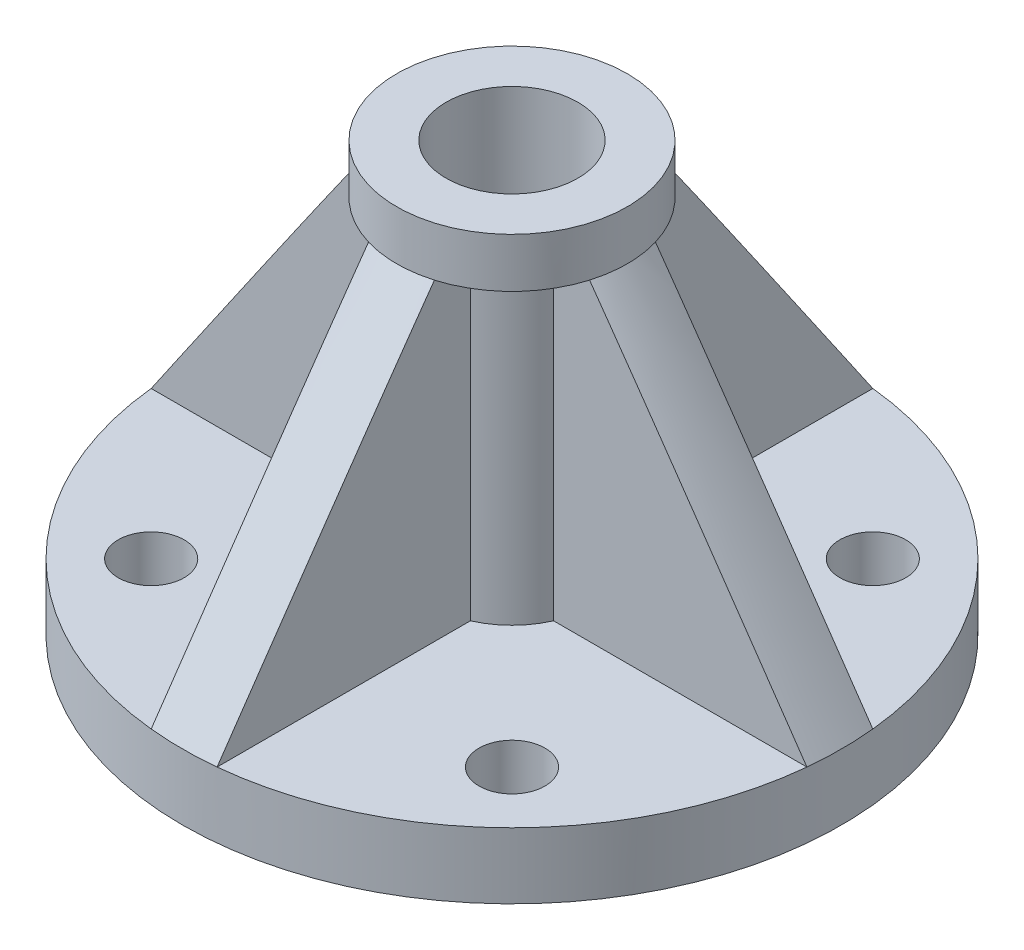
ISO-10303-21;
HEADER;
FILE_DESCRIPTION(('STEP AP214'),'2;1');
FILE_NAME('part.step','',(''),(''),'','','');
FILE_SCHEMA(('AUTOMOTIVE_DESIGN { 1 0 10303 214 1 1 1 1 }'));
ENDSEC;
DATA;
#1=APPLICATION_CONTEXT('core data for automotive mechanical design processes');
#2=APPLICATION_PROTOCOL_DEFINITION('international standard','automotive_design',2000,#1);
#3=PRODUCT_CONTEXT('',#1,'mechanical');
#4=PRODUCT('Part','Part','',(#3));
#5=PRODUCT_RELATED_PRODUCT_CATEGORY('part','',(#4));
#6=PRODUCT_DEFINITION_FORMATION('','',#4);
#7=PRODUCT_DEFINITION_CONTEXT('part definition',#1,'design');
#8=PRODUCT_DEFINITION('design','',#6,#7);
#9=PRODUCT_DEFINITION_SHAPE('','',#8);
#10=(LENGTH_UNIT() NAMED_UNIT(*) SI_UNIT(.MILLI.,.METRE.));
#11=(NAMED_UNIT(*) PLANE_ANGLE_UNIT() SI_UNIT($,.RADIAN.));
#12=(NAMED_UNIT(*) SI_UNIT($,.STERADIAN.) SOLID_ANGLE_UNIT());
#13=UNCERTAINTY_MEASURE_WITH_UNIT(LENGTH_MEASURE(1.E-05),#10,'distance_accuracy_value','');
#14=(GEOMETRIC_REPRESENTATION_CONTEXT(3) GLOBAL_UNCERTAINTY_ASSIGNED_CONTEXT((#13)) GLOBAL_UNIT_ASSIGNED_CONTEXT((#10,
#11,#12)) REPRESENTATION_CONTEXT('',''));
#15=CARTESIAN_POINT('',(0.,0.,0.));
#16=DIRECTION('',(0.,0.,1.));
#17=DIRECTION('',(1.,0.,0.));
#18=AXIS2_PLACEMENT_3D('',#15,#16,#17);
#19=CARTESIAN_POINT('',(0.,57.5,0.));
#20=DIRECTION('',(0.,-1.,0.));
#21=DIRECTION('',(0.,0.,-1.));
#22=AXIS2_PLACEMENT_3D('',#19,#20,#21);
#23=CONICAL_SURFACE('',#22,17.5,0.600050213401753);
#24=CARTESIAN_POINT('',(0.,10.,0.));
#25=DIRECTION('',(0.,-1.,0.));
#26=DIRECTION('',(0.,0.,-1.));
#27=AXIS2_PLACEMENT_3D('',#24,#25,#26);
#28=CIRCLE('',#27,50.);
#29=CARTESIAN_POINT('',(-49.7493718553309,10.,5.00000000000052));
#30=VERTEX_POINT('',#29);
#31=CARTESIAN_POINT('',(-49.749371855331,9.99999999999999,-4.99999999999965));
#32=VERTEX_POINT('',#31);
#33=EDGE_CURVE('E266',#30,#32,#28,.T.);
#34=ORIENTED_EDGE('',*,*,#33,.F.);
#35=CARTESIAN_POINT('',(-74.9180269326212,-26.6622400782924,5.00000000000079));
#36=CARTESIAN_POINT('',(-72.6324705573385,-23.3292648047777,5.00000000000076));
#37=CARTESIAN_POINT('',(-70.3466327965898,-19.9964823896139,5.00000000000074));
#38=CARTESIAN_POINT('',(-65.774104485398,-13.3314957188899,5.00000000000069));
#39=CARTESIAN_POINT('',(-63.487413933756,-9.99929146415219,5.00000000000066));
#40=CARTESIAN_POINT('',(-58.9125858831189,-3.33521053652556,5.00000000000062));
#41=CARTESIAN_POINT('',(-56.6244482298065,-0.00333396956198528,5.00000000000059));
#42=CARTESIAN_POINT('',(-52.0465481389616,6.65929662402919,5.00000000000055));
#43=CARTESIAN_POINT('',(-49.7567857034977,9.99005065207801,5.00000000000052));
#44=CARTESIAN_POINT('',(-45.2232468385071,16.5795528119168,5.00000000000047));
#45=CARTESIAN_POINT('',(-42.9795208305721,19.8383356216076,5.00000000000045));
#46=CARTESIAN_POINT('',(-39.6111721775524,24.7246170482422,5.00000000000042));
#47=CARTESIAN_POINT('',(-38.4879271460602,26.3530652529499,5.0000000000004));
#48=CARTESIAN_POINT('',(-36.2402359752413,29.60913211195,5.00000000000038));
#49=CARTESIAN_POINT('',(-35.1157898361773,31.2367507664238,5.00000000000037));
#50=CARTESIAN_POINT('',(-32.8654372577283,34.4907128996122,5.00000000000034));
#51=CARTESIAN_POINT('',(-31.739530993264,36.1170564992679,5.00000000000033));
#52=CARTESIAN_POINT('',(-29.4855578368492,39.3682453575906,5.00000000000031));
#53=CARTESIAN_POINT('',(-28.3574909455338,40.993090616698,5.0000000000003));
#54=CARTESIAN_POINT('',(-26.0983273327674,44.2406602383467,5.00000000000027));
#55=CARTESIAN_POINT('',(-24.9672306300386,45.8633846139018,5.00000000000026));
#56=CARTESIAN_POINT('',(-23.2671963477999,48.2950999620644,5.00000000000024));
#57=CARTESIAN_POINT('',(-22.6999538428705,49.1052758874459,5.00000000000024));
#58=CARTESIAN_POINT('',(-21.5640522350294,50.7246338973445,5.00000000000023));
#59=CARTESIAN_POINT('',(-20.9953931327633,51.5338159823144,5.00000000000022));
#60=CARTESIAN_POINT('',(-19.9847248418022,52.9685832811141,5.00000000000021));
#61=CARTESIAN_POINT('',(-19.5430737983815,53.5944207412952,5.00000000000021));
#62=CARTESIAN_POINT('',(-18.6584631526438,54.8451716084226,5.0000000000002));
#63=CARTESIAN_POINT('',(-18.2155035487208,55.4700850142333,5.00000000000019));
#64=CARTESIAN_POINT('',(-17.327887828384,56.7188868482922,5.00000000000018));
#65=CARTESIAN_POINT('',(-16.8832314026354,57.3427750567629,5.00000000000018));
#66=CARTESIAN_POINT('',(-15.9919006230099,58.5891067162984,5.00000000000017));
#67=CARTESIAN_POINT('',(-15.5452262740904,59.2115501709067,5.00000000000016));
#68=CARTESIAN_POINT('',(-14.6461827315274,60.4589118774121,5.00000000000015));
#69=CARTESIAN_POINT('',(-14.1937955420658,61.083817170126,5.00000000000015));
#70=CARTESIAN_POINT('',(-13.2856098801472,62.3311425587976,5.00000000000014));
#71=CARTESIAN_POINT('',(-12.8298114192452,62.9535626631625,5.00000000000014));
#72=CARTESIAN_POINT('',(-11.9138758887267,64.1947253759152,5.00000000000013));
#73=CARTESIAN_POINT('',(-11.4537411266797,64.8134696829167,5.00000000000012));
#74=CARTESIAN_POINT('',(-10.7587737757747,65.7379944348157,5.00000000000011));
#75=CARTESIAN_POINT('',(-10.5263262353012,66.0455675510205,5.00000000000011));
#76=CARTESIAN_POINT('',(-10.0595163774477,66.659256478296,5.00000000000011));
#77=CARTESIAN_POINT('',(-9.82515406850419,66.9653722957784,5.0000000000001));
#78=CARTESIAN_POINT('',(-9.35410484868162,67.5758336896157,5.0000000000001));
#79=CARTESIAN_POINT('',(-9.11741783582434,67.8801791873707,5.0000000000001));
#80=CARTESIAN_POINT('',(-8.64120573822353,68.4866414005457,5.00000000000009));
#81=CARTESIAN_POINT('',(-8.40168066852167,68.7887581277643,5.00000000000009));
#82=CARTESIAN_POINT('',(-7.91874867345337,69.3905999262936,5.00000000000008));
#83=CARTESIAN_POINT('',(-7.67533663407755,69.6903209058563,5.00000000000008));
#84=CARTESIAN_POINT('',(-7.30685839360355,70.1371067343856,5.00000000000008));
#85=CARTESIAN_POINT('',(-7.18347823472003,70.2855624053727,5.00000000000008));
#86=CARTESIAN_POINT('',(-6.93542837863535,70.5814075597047,5.00000000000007));
#87=CARTESIAN_POINT('',(-6.81075860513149,70.7287969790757,5.00000000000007));
#88=CARTESIAN_POINT('',(-6.43644548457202,71.1669066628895,5.00000000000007));
#89=CARTESIAN_POINT('',(-6.1846616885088,71.4558059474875,5.00000000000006));
#90=CARTESIAN_POINT('',(-5.67356875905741,72.0268682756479,5.00000000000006));
#91=CARTESIAN_POINT('',(-5.41426046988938,72.3090320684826,5.00000000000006));
#92=CARTESIAN_POINT('',(-5.01787169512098,72.7246627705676,5.00000000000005));
#93=CARTESIAN_POINT('',(-4.88464310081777,72.8618020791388,5.00000000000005));
#94=CARTESIAN_POINT('',(-4.61516309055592,73.1330722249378,5.00000000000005));
#95=CARTESIAN_POINT('',(-4.47891185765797,73.2672032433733,5.00000000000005));
#96=CARTESIAN_POINT('',(-4.20290909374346,73.5316564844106,5.00000000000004));
#97=CARTESIAN_POINT('',(-4.06315969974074,73.6619809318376,5.00000000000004));
#98=CARTESIAN_POINT('',(-3.7794128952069,73.9179052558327,5.00000000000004));
#99=CARTESIAN_POINT('',(-3.63541625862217,74.0435059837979,5.00000000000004));
#100=CARTESIAN_POINT('',(-3.43328550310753,74.2125530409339,5.00000000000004));
#101=CARTESIAN_POINT('',(-3.37732705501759,74.2586080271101,5.00000000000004));
#102=CARTESIAN_POINT('',(-3.26462201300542,74.3497451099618,5.00000000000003));
#103=CARTESIAN_POINT('',(-3.20787540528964,74.3948271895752,5.00000000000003));
#104=CARTESIAN_POINT('',(-3.03636096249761,74.5284700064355,5.00000000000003));
#105=CARTESIAN_POINT('',(-2.92032682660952,74.6154203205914,5.00000000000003));
#106=CARTESIAN_POINT('',(-2.68411139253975,74.7842138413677,5.00000000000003));
#107=CARTESIAN_POINT('',(-2.56391979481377,74.8660427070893,5.00000000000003));
#108=CARTESIAN_POINT('',(-2.31919150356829,75.0229896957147,5.00000000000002));
#109=CARTESIAN_POINT('',(-2.19465462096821,75.0981075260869,5.00000000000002));
#110=CARTESIAN_POINT('',(-1.93847322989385,75.2411940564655,5.00000000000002));
#111=CARTESIAN_POINT('',(-1.80674009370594,75.3090057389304,5.00000000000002));
#112=CARTESIAN_POINT('',(-1.53806045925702,75.4335642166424,5.00000000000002));
#113=CARTESIAN_POINT('',(-1.40111360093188,75.4903102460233,5.00000000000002));
#114=CARTESIAN_POINT('',(-1.12294072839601,75.5897770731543,5.00000000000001));
#115=CARTESIAN_POINT('',(-0.981740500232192,75.6325688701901,5.00000000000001));
#116=CARTESIAN_POINT('',(-0.695386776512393,75.7017705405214,5.00000000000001));
#117=CARTESIAN_POINT('',(-0.550236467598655,75.7281932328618,5.00000000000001));
#118=CARTESIAN_POINT('',(-0.302873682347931,75.7573241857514,5.));
#119=CARTESIAN_POINT('',(-0.201211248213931,75.7648307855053,5.));
#120=CARTESIAN_POINT('',(0.00237216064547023,75.7707417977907,5.));
#121=CARTESIAN_POINT('',(0.104293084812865,75.7691478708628,5.));
#122=CARTESIAN_POINT('',(0.307639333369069,75.7569186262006,5.));
#123=CARTESIAN_POINT('',(0.409064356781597,75.7462783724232,5.));
#124=CARTESIAN_POINT('',(0.610638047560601,75.7163947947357,4.99999999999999));
#125=CARTESIAN_POINT('',(0.710786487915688,75.6971499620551,4.99999999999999));
#126=CARTESIAN_POINT('',(0.939071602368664,75.6437916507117,4.99999999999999));
#127=CARTESIAN_POINT('',(1.06657069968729,75.6069474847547,4.99999999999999));
#128=CARTESIAN_POINT('',(1.31770733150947,75.5218296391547,4.99999999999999));
#129=CARTESIAN_POINT('',(1.44134249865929,75.4735491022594,4.99999999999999));
#130=CARTESIAN_POINT('',(1.68481373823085,75.3673872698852,4.99999999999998));
#131=CARTESIAN_POINT('',(1.80463742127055,75.3094778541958,4.99999999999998));
#132=CARTESIAN_POINT('',(2.04017003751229,75.1859398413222,4.99999999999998));
#133=CARTESIAN_POINT('',(2.15587959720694,75.1203124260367,4.99999999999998));
#134=CARTESIAN_POINT('',(2.4308986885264,74.954175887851,4.99999999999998));
#135=CARTESIAN_POINT('',(2.588301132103,74.8505208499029,4.99999999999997));
#136=CARTESIAN_POINT('',(2.89656573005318,74.6338551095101,4.99999999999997));
#137=CARTESIAN_POINT('',(3.04742418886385,74.5208392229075,4.99999999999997));
#138=CARTESIAN_POINT('',(3.3438779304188,74.2875104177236,4.99999999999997));
#139=CARTESIAN_POINT('',(3.48946120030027,74.1671823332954,4.99999999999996));
#140=CARTESIAN_POINT('',(3.77589848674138,73.921111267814,4.99999999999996));
#141=CARTESIAN_POINT('',(3.91675342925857,73.7953693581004,4.99999999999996));
#142=CARTESIAN_POINT('',(4.1955264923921,73.538702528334,4.99999999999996));
#143=CARTESIAN_POINT('',(4.33341609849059,73.4077467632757,4.99999999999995));
#144=CARTESIAN_POINT('',(4.60583909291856,73.1423906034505,4.99999999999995));
#145=CARTESIAN_POINT('',(4.74037235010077,73.0079900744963,4.99999999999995));
#146=CARTESIAN_POINT('',(5.00641312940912,72.7365912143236,4.99999999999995));
#147=CARTESIAN_POINT('',(5.13792450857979,72.599596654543,4.99999999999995));
#148=CARTESIAN_POINT('',(5.39852328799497,72.3233352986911,4.99999999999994));
#149=CARTESIAN_POINT('',(5.52761077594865,72.1840685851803,4.99999999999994));
#150=CARTESIAN_POINT('',(5.80265146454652,71.8829048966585,4.99999999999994));
#151=CARTESIAN_POINT('',(5.94827524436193,71.7207074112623,4.99999999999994));
#152=CARTESIAN_POINT('',(6.23721059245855,71.3942637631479,4.99999999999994));
#153=CARTESIAN_POINT('',(6.38052210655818,71.230017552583,4.99999999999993));
#154=CARTESIAN_POINT('',(6.80754022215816,70.7347110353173,4.99999999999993));
#155=CARTESIAN_POINT('',(7.08830329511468,70.4011128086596,4.99999999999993));
#156=CARTESIAN_POINT('',(7.64409821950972,69.7289891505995,4.99999999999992));
#157=CARTESIAN_POINT('',(7.91912786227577,69.3904619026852,4.99999999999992));
#158=CARTESIAN_POINT('',(8.46472076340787,68.7098208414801,4.99999999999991));
#159=CARTESIAN_POINT('',(8.73528392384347,68.3677069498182,4.99999999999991));
#160=CARTESIAN_POINT('',(9.27333779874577,67.6802044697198,4.9999999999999));
#161=CARTESIAN_POINT('',(9.54082298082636,67.3348115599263,4.9999999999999));
#162=CARTESIAN_POINT('',(10.0730001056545,66.6418768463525,4.9999999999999));
#163=CARTESIAN_POINT('',(10.337692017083,66.2943350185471,4.99999999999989));
#164=CARTESIAN_POINT('',(10.8647491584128,65.5976231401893,4.99999999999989));
#165=CARTESIAN_POINT('',(11.1271149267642,65.2484534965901,4.99999999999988));
#166=CARTESIAN_POINT('',(11.6499851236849,64.5487226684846,4.99999999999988));
#167=CARTESIAN_POINT('',(11.9104895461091,64.1981614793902,4.99999999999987));
#168=CARTESIAN_POINT('',(12.6875220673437,63.1477128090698,4.99999999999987));
#169=CARTESIAN_POINT('',(13.2017701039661,62.4461389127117,4.99999999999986));
#170=CARTESIAN_POINT('',(14.2259525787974,61.0397953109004,4.99999999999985));
#171=CARTESIAN_POINT('',(14.7358867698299,60.335025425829,4.99999999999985));
#172=CARTESIAN_POINT('',(15.7521434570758,58.9237019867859,4.99999999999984));
#173=CARTESIAN_POINT('',(16.2584684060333,58.2171501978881,4.99999999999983));
#174=CARTESIAN_POINT('',(17.2686669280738,56.8022960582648,4.99999999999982));
#175=CARTESIAN_POINT('',(17.7725404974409,56.0939937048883,4.99999999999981));
#176=CARTESIAN_POINT('',(18.8683862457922,54.5491489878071,4.9999999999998));
#177=CARTESIAN_POINT('',(19.4599861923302,53.7123426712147,4.9999999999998));
#178=CARTESIAN_POINT('',(20.6412772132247,52.0371368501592,4.99999999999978));
#179=CARTESIAN_POINT('',(21.2309678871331,51.1987370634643,4.99999999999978));
#180=CARTESIAN_POINT('',(22.4095818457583,49.5196706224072,4.99999999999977));
#181=CARTESIAN_POINT('',(22.9985029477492,48.6790024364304,4.99999999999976));
#182=CARTESIAN_POINT('',(24.1749480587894,46.9969422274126,4.99999999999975));
#183=CARTESIAN_POINT('',(24.7624723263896,46.1555503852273,4.99999999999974));
#184=CARTESIAN_POINT('',(25.3495109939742,45.3138206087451,4.99999999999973));
#185=B_SPLINE_CURVE_WITH_KNOTS('',3,(#35,#36,#37,#38,#39,#40,#41,#42,#43,#44,#45,#46,#47,#48,
#49,#50,#51,#52,#53,#54,#55,#56,#57,#58,#59,#60,#61,#62,#63,#64,#65,#66,#67,#68,#69,#70,#71,#72,
#73,#74,#75,#76,#77,#78,#79,#80,#81,#82,#83,#84,#85,#86,#87,#88,#89,#90,#91,#92,#93,#94,#95,#96,
#97,#98,#99,#100,#101,#102,#103,#104,#105,#106,#107,#108,#109,#110,#111,#112,#113,#114,#115,
#116,#117,#118,#119,#120,#121,#122,#123,#124,#125,#126,#127,#128,#129,#130,#131,#132,#133,#134,
#135,#136,#137,#138,#139,#140,#141,#142,#143,#144,#145,#146,#147,#148,#149,#150,#151,#152,#153,
#154,#155,#156,#157,#158,#159,#160,#161,#162,#163,#164,#165,#166,#167,#168,#169,#170,#171,#172,
#173,#174,#175,#176,#177,#178,#179,#180,#181,#182,#183,#184),.UNSPECIFIED.,.F.,.F.,(4,2,2,2,2,2,
2,2,2,2,2,2,2,2,2,2,2,2,2,2,2,2,2,2,2,2,2,2,2,2,2,2,2,2,2,2,2,2,2,2,2,2,2,2,2,2,2,2,2,2,2,2,2,2,
2,2,2,2,2,2,2,2,2,2,2,2,2,2,2,2,2,2,2,2,4),(0.,12.1240435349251,24.2481041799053,
36.3738111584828,48.4995027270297,60.3690310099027,66.3038184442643,72.2386045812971,
78.1727355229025,84.1068647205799,90.0409573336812,93.007998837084,95.9750389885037,
98.2729831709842,100.570930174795,102.869318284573,105.167700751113,107.48209169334,
109.796474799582,112.109688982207,113.266271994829,114.422849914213,115.579478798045,
116.736101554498,117.894397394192,118.473490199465,119.052617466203,120.202188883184,
121.351631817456,121.925192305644,122.498718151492,123.071901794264,123.644981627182,
123.862392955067,124.079808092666,124.514670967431,124.950701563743,125.386751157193,
125.830825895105,126.274931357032,126.716740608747,127.158203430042,127.463644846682,
127.769030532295,128.074582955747,128.380188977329,128.777673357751,129.175396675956,
129.574302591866,129.97314750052,130.53806656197,131.103300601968,131.669749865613,
132.236087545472,132.806510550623,133.376955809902,133.946627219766,134.51627797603,
135.170184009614,135.824105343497,137.132069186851,138.44052791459,139.749015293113,
141.059570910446,142.37014120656,143.680399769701,144.990662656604,147.600216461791,
150.209918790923,152.817635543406,155.425356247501,158.499781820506,161.57481512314,
164.654092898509,167.732747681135),.UNSPECIFIED.);
#186=CARTESIAN_POINT('',(-16.7705098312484,57.5,5.00000000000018));
#187=VERTEX_POINT('',#186);
#188=EDGE_CURVE('E12',#30,#187,#185,.T.);
#189=ORIENTED_EDGE('',*,*,#188,.T.);
#190=CARTESIAN_POINT('',(0.,57.5,0.));
#191=DIRECTION('',(0.,-1.,0.));
#192=DIRECTION('',(0.,0.,-1.));
#193=AXIS2_PLACEMENT_3D('',#190,#191,#192);
#194=CIRCLE('',#193,17.5);
#195=CARTESIAN_POINT('',(-16.7705098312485,57.5,-4.99999999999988));
#196=VERTEX_POINT('',#195);
#197=EDGE_CURVE('E271',#187,#196,#194,.T.);
#198=ORIENTED_EDGE('',*,*,#197,.T.);
#199=CARTESIAN_POINT('',(25.3495109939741,45.3138206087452,-5.00000000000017));
#200=CARTESIAN_POINT('',(24.984125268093,45.8377490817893,-5.00000000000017));
#201=CARTESIAN_POINT('',(24.6185430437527,46.3615404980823,-5.00000000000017));
#202=CARTESIAN_POINT('',(23.8869239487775,47.4088061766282,-5.00000000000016));
#203=CARTESIAN_POINT('',(23.5208870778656,47.9322804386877,-5.00000000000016));
#204=CARTESIAN_POINT('',(22.4218852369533,49.5023297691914,-5.00000000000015));
#205=CARTESIAN_POINT('',(21.6881461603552,50.5483633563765,-5.00000000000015));
#206=CARTESIAN_POINT('',(20.2145138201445,52.6433131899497,-5.00000000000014));
#207=CARTESIAN_POINT('',(19.4746077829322,53.6922204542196,-5.00000000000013));
#208=CARTESIAN_POINT('',(17.9910639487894,55.7871562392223,-5.00000000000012));
#209=CARTESIAN_POINT('',(17.2474267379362,56.8331851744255,-5.00000000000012));
#210=CARTESIAN_POINT('',(16.0719118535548,58.4774025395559,-5.00000000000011));
#211=CARTESIAN_POINT('',(15.6418994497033,59.076924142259,-5.0000000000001));
#212=CARTESIAN_POINT('',(14.7795333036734,60.2742802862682,-5.0000000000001));
#213=CARTESIAN_POINT('',(14.347179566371,60.8721148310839,-5.0000000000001));
#214=CARTESIAN_POINT('',(13.4792426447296,62.0658956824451,-5.00000000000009));
#215=CARTESIAN_POINT('',(13.0436579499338,62.6618408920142,-5.00000000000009));
#216=CARTESIAN_POINT('',(12.1685218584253,63.8507815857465,-5.00000000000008));
#217=CARTESIAN_POINT('',(11.7289706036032,64.4437771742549,-5.00000000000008));
#218=CARTESIAN_POINT('',(10.8457400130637,65.6240491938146,-5.00000000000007));
#219=CARTESIAN_POINT('',(10.4020761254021,66.2113371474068,-5.00000000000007));
#220=CARTESIAN_POINT('',(9.73085662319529,67.087960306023,-5.00000000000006));
#221=CARTESIAN_POINT('',(9.50614494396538,67.3794726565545,-5.00000000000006));
#222=CARTESIAN_POINT('',(9.05441612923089,67.9607047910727,-5.00000000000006));
#223=CARTESIAN_POINT('',(8.82739900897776,68.2504245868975,-5.00000000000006));
#224=CARTESIAN_POINT('',(8.37074454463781,68.827395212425,-5.00000000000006));
#225=CARTESIAN_POINT('',(8.14110958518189,69.1146479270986,-5.00000000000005));
#226=CARTESIAN_POINT('',(7.67835948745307,69.6863350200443,-5.00000000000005));
#227=CARTESIAN_POINT('',(7.44524440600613,69.9707694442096,-5.00000000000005));
#228=CARTESIAN_POINT('',(6.97468248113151,70.535917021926,-5.00000000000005));
#229=CARTESIAN_POINT('',(6.73723674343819,70.816631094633,-5.00000000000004));
#230=CARTESIAN_POINT('',(6.25672438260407,71.3731971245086,-5.00000000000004));
#231=CARTESIAN_POINT('',(6.01365823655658,71.6490494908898,-5.00000000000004));
#232=CARTESIAN_POINT('',(5.70861600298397,71.9858916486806,-5.00000000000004));
#233=CARTESIAN_POINT('',(5.65013546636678,72.0500533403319,-5.00000000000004));
#234=CARTESIAN_POINT('',(5.53272732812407,72.1779673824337,-5.00000000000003));
#235=CARTESIAN_POINT('',(5.47379972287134,72.2417197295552,-5.00000000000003));
#236=CARTESIAN_POINT('',(5.29629598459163,72.4323164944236,-5.00000000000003));
#237=CARTESIAN_POINT('',(5.17700331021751,72.5584957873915,-5.00000000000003));
#238=CARTESIAN_POINT('',(4.93613607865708,72.8088209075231,-5.00000000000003));
#239=CARTESIAN_POINT('',(4.8145600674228,72.9329653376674,-5.00000000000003));
#240=CARTESIAN_POINT('',(4.56884957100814,73.1786969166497,-5.00000000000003));
#241=CARTESIAN_POINT('',(4.44471514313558,73.3002841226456,-5.00000000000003));
#242=CARTESIAN_POINT('',(4.19447617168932,73.5393643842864,-5.00000000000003));
#243=CARTESIAN_POINT('',(4.06839578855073,73.6568826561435,-5.00000000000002));
#244=CARTESIAN_POINT('',(3.81279824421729,73.8881165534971,-5.00000000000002));
#245=CARTESIAN_POINT('',(3.68328134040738,74.0018324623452,-5.00000000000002));
#246=CARTESIAN_POINT('',(3.4203220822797,74.2244001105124,-5.00000000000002));
#247=CARTESIAN_POINT('',(3.286883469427,74.3332562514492,-5.00000000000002));
#248=CARTESIAN_POINT('',(3.01529436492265,74.5448933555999,-5.00000000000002));
#249=CARTESIAN_POINT('',(2.87714524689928,74.6476760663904,-5.00000000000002));
#250=CARTESIAN_POINT('',(2.6310070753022,74.8203702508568,-5.00000000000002));
#251=CARTESIAN_POINT('',(2.5242375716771,74.8920156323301,-5.00000000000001));
#252=CARTESIAN_POINT('',(2.30727167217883,75.0299682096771,-5.00000000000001));
#253=CARTESIAN_POINT('',(2.1970750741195,75.0962750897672,-5.00000000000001));
#254=CARTESIAN_POINT('',(1.97306087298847,75.2222868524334,-5.00000000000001));
#255=CARTESIAN_POINT('',(1.85924625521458,75.2819970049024,-5.00000000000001));
#256=CARTESIAN_POINT('',(1.62773856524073,75.3934003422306,-5.00000000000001));
#257=CARTESIAN_POINT('',(1.51004619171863,75.4450949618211,-5.00000000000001));
#258=CARTESIAN_POINT('',(1.29139215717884,75.5307138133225,-5.00000000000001));
#259=CARTESIAN_POINT('',(1.19103111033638,75.566165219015,-5.00000000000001));
#260=CARTESIAN_POINT('',(0.987920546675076,75.6293627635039,-5.));
#261=CARTESIAN_POINT('',(0.885171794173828,75.6571113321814,-5.));
#262=CARTESIAN_POINT('',(0.677829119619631,75.7039025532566,-5.));
#263=CARTESIAN_POINT('',(0.573237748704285,75.7229563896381,-5.));
#264=CARTESIAN_POINT('',(0.362757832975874,75.7516229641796,-5.));
#265=CARTESIAN_POINT('',(0.2568693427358,75.7612360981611,-5.));
#266=CARTESIAN_POINT('',(0.0440819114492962,75.7706082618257,-5.));
#267=CARTESIAN_POINT('',(-0.0628194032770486,75.7703141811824,-5.));
#268=CARTESIAN_POINT('',(-0.276121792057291,75.7597546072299,-4.99999999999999));
#269=CARTESIAN_POINT('',(-0.382522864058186,75.7494890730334,-4.99999999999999));
#270=CARTESIAN_POINT('',(-0.594057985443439,75.719443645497,-4.99999999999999));
#271=CARTESIAN_POINT('',(-0.699190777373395,75.6996549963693,-4.99999999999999));
#272=CARTESIAN_POINT('',(-0.907429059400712,75.6513801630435,-4.99999999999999));
#273=CARTESIAN_POINT('',(-1.01053421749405,75.6228925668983,-4.99999999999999));
#274=CARTESIAN_POINT('',(-1.25533909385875,75.5451889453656,-4.99999999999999));
#275=CARTESIAN_POINT('',(-1.39585567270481,75.492245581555,-4.99999999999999));
#276=CARTESIAN_POINT('',(-1.67160638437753,75.3740673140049,-4.99999999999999));
#277=CARTESIAN_POINT('',(-1.80683750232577,75.3088255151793,-4.99999999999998));
#278=CARTESIAN_POINT('',(-2.0725672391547,75.168374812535,-4.99999999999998));
#279=CARTESIAN_POINT('',(-2.20304784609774,75.0931321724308,-4.99999999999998));
#280=CARTESIAN_POINT('',(-2.45916144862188,74.9349569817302,-4.99999999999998));
#281=CARTESIAN_POINT('',(-2.58479576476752,74.8520265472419,-4.99999999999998));
#282=CARTESIAN_POINT('',(-2.91419717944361,74.6227526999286,-4.99999999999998));
#283=CARTESIAN_POINT('',(-3.11419153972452,74.4710044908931,-4.99999999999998));
#284=CARTESIAN_POINT('',(-3.50484462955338,74.1558545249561,-4.99999999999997));
#285=CARTESIAN_POINT('',(-3.69549642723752,73.9924443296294,-4.99999999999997));
#286=CARTESIAN_POINT('',(-4.06978793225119,73.6569372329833,-4.99999999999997));
#287=CARTESIAN_POINT('',(-4.25340943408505,73.4848201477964,-4.99999999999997));
#288=CARTESIAN_POINT('',(-4.61463768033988,73.1345237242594,-4.99999999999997));
#289=CARTESIAN_POINT('',(-4.79224607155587,72.9563460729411,-4.99999999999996));
#290=CARTESIAN_POINT('',(-5.14381900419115,72.5941934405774,-4.99999999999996));
#291=CARTESIAN_POINT('',(-5.31775237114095,72.4101883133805,-4.99999999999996));
#292=CARTESIAN_POINT('',(-5.66169780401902,72.0385408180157,-4.99999999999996));
#293=CARTESIAN_POINT('',(-5.83170964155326,71.8508982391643,-4.99999999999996));
#294=CARTESIAN_POINT('',(-6.16824413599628,71.4730392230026,-4.99999999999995));
#295=CARTESIAN_POINT('',(-6.33477180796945,71.2828272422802,-4.99999999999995));
#296=CARTESIAN_POINT('',(-6.66514450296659,70.9001027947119,-4.99999999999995));
#297=CARTESIAN_POINT('',(-6.82898960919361,70.7075903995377,-4.99999999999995));
#298=CARTESIAN_POINT('',(-7.31211823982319,70.1332553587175,-4.99999999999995));
#299=CARTESIAN_POINT('',(-7.62819345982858,69.748734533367,-4.99999999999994));
#300=CARTESIAN_POINT('',(-8.25407838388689,68.9746176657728,-4.99999999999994));
#301=CARTESIAN_POINT('',(-8.5638877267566,68.5850213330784,-4.99999999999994));
#302=CARTESIAN_POINT('',(-9.17883147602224,67.8020514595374,-4.99999999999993));
#303=CARTESIAN_POINT('',(-9.48396505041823,67.4086772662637,-4.99999999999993));
#304=CARTESIAN_POINT('',(-10.0905904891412,66.6191297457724,-4.99999999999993));
#305=CARTESIAN_POINT('',(-10.3920823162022,66.2229563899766,-4.99999999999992));
#306=CARTESIAN_POINT('',(-10.9925187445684,65.4280196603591,-4.99999999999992));
#307=CARTESIAN_POINT('',(-11.2914602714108,65.0292539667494,-4.99999999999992));
#308=CARTESIAN_POINT('',(-11.8870364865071,64.2300022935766,-4.99999999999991));
#309=CARTESIAN_POINT('',(-12.1836711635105,63.8295163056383,-4.99999999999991));
#310=CARTESIAN_POINT('',(-13.0707174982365,62.6260889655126,-4.99999999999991));
#311=CARTESIAN_POINT('',(-13.6583374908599,61.8210903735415,-4.9999999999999));
#312=CARTESIAN_POINT('',(-14.8246966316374,60.2126101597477,-4.99999999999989));
#313=CARTESIAN_POINT('',(-15.4034686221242,59.4091522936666,-4.99999999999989));
#314=CARTESIAN_POINT('',(-16.5573834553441,57.7996044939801,-4.99999999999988));
#315=CARTESIAN_POINT('',(-17.1325262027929,56.9935144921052,-4.99999999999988));
#316=CARTESIAN_POINT('',(-18.2797953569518,55.3798365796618,-4.99999999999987));
#317=CARTESIAN_POINT('',(-18.8519232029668,54.5722496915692,-4.99999999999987));
#318=CARTESIAN_POINT('',(-19.9941003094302,52.9556187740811,-4.99999999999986));
#319=CARTESIAN_POINT('',(-20.5641495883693,52.1465747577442,-4.99999999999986));
#320=CARTESIAN_POINT('',(-21.6973629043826,50.5348344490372,-4.99999999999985));
#321=CARTESIAN_POINT('',(-22.260541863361,49.7321486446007,-4.99999999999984));
#322=CARTESIAN_POINT('',(-23.3856265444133,48.1258850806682,-4.99999999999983));
#323=CARTESIAN_POINT('',(-23.9475322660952,47.3223073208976,-4.99999999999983));
#324=CARTESIAN_POINT('',(-25.6317152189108,44.9104996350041,-4.99999999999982));
#325=CARTESIAN_POINT('',(-26.7524567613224,43.3011974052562,-4.99999999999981));
#326=CARTESIAN_POINT('',(-28.9911597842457,40.080643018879,-4.9999999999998));
#327=CARTESIAN_POINT('',(-30.1091212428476,38.4693908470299,-4.99999999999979));
#328=CARTESIAN_POINT('',(-32.343040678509,35.245497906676,-4.99999999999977));
#329=CARTESIAN_POINT('',(-33.4589986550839,33.6328571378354,-4.99999999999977));
#330=CARTESIAN_POINT('',(-35.6897200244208,30.4061374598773,-4.99999999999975));
#331=CARTESIAN_POINT('',(-36.8044830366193,28.7920582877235,-4.99999999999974));
#332=CARTESIAN_POINT('',(-39.0328784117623,25.5631193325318,-4.99999999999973));
#333=CARTESIAN_POINT('',(-40.1465107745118,23.9482595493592,-4.99999999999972));
#334=CARTESIAN_POINT('',(-43.4860944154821,19.1027940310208,-4.9999999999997));
#335=CARTESIAN_POINT('',(-45.7107411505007,15.8712892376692,-4.99999999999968));
#336=CARTESIAN_POINT('',(-50.1862115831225,9.36549659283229,-4.99999999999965));
#337=CARTESIAN_POINT('',(-52.4370068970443,6.09118922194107,-4.99999999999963));
#338=CARTESIAN_POINT('',(-56.937056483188,-0.458490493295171,-4.9999999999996));
#339=CARTESIAN_POINT('',(-59.1863107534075,-3.73386283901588,-4.99999999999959));
#340=CARTESIAN_POINT('',(-63.6830969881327,-10.2844273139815,-4.99999999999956));
#341=CARTESIAN_POINT('',(-65.9306292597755,-13.559619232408,-4.99999999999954));
#342=CARTESIAN_POINT('',(-70.4248744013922,-20.1105583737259,-4.99999999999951));
#343=CARTESIAN_POINT('',(-72.6715872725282,-23.38630559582,-4.99999999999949));
#344=CARTESIAN_POINT('',(-74.9180269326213,-26.6622400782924,-4.99999999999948));
#345=B_SPLINE_CURVE_WITH_KNOTS('',3,(#199,#200,#201,#202,#203,#204,#205,#206,#207,#208,#209,
#210,#211,#212,#213,#214,#215,#216,#217,#218,#219,#220,#221,#222,#223,#224,#225,#226,#227,#228,
#229,#230,#231,#232,#233,#234,#235,#236,#237,#238,#239,#240,#241,#242,#243,#244,#245,#246,#247,
#248,#249,#250,#251,#252,#253,#254,#255,#256,#257,#258,#259,#260,#261,#262,#263,#264,#265,#266,
#267,#268,#269,#270,#271,#272,#273,#274,#275,#276,#277,#278,#279,#280,#281,#282,#283,#284,#285,
#286,#287,#288,#289,#290,#291,#292,#293,#294,#295,#296,#297,#298,#299,#300,#301,#302,#303,#304,
#305,#306,#307,#308,#309,#310,#311,#312,#313,#314,#315,#316,#317,#318,#319,#320,#321,#322,#323,
#324,#325,#326,#327,#328,#329,#330,#331,#332,#333,#334,#335,#336,#337,#338,#339,#340,#341,#342,
#343,#344),.UNSPECIFIED.,.F.,.F.,(4,2,2,2,2,2,2,2,2,2,2,2,2,2,2,2,2,2,2,2,2,2,2,2,2,2,2,2,2,2,2,
2,2,2,2,2,2,2,2,2,2,2,2,2,2,2,2,2,2,2,2,2,2,2,2,2,2,2,2,2,2,2,2,2,2,2,2,2,2,2,2,2,4),(0.,
1.91626447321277,3.83253011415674,7.6656758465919,11.5165154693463,15.3667680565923,
17.5801393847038,19.7935061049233,22.0079825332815,24.2223800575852,26.4304289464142,
27.5346271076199,28.6388179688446,29.7420726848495,30.8453094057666,31.9482682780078,
33.0511338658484,33.3115746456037,33.5720175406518,34.0929229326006,34.6141721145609,
35.1354096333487,35.6524175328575,36.1693868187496,36.6858779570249,37.2022197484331,
37.5878328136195,37.9734686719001,38.3587941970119,38.7440506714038,39.0631000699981,
39.382048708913,39.7005859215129,40.0191097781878,40.3393414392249,40.6595744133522,
40.9801023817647,41.3006824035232,41.7503952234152,42.2003609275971,42.651884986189,
43.1032851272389,43.8557387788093,44.6087425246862,45.3635798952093,46.1182088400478,
46.877741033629,47.6373173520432,48.395712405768,49.1540838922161,50.6472423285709,
52.1404865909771,53.6339935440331,55.1275157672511,56.6226378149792,58.1177671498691,
61.1076961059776,64.0783230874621,67.0490277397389,70.0181551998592,72.9872561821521,
75.9288996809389,78.87054408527,84.7538406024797,90.6371833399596,96.5205275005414,
102.405383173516,108.29023986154,120.059906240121,131.979826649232,143.899762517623,
155.816328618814,167.73287775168),.UNSPECIFIED.);
#346=EDGE_CURVE('E330',#196,#32,#345,.T.);
#347=ORIENTED_EDGE('',*,*,#346,.T.);
#348=EDGE_LOOP('',(#34,#189,#198,#347));
#349=FACE_BOUND('',#348,.T.);
#350=ADVANCED_FACE('F35',(#349),#23,.T.);
#351=CARTESIAN_POINT('',(-5.00000000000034,10.,-49.7493718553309));
#352=VERTEX_POINT('',#351);
#353=CARTESIAN_POINT('',(4.99999999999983,9.99999999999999,-49.749371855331));
#354=VERTEX_POINT('',#353);
#355=EDGE_CURVE('E331',#352,#354,#28,.T.);
#356=ORIENTED_EDGE('',*,*,#355,.F.);
#357=CARTESIAN_POINT('',(-5.00000000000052,-26.6622400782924,-74.9180269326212));
#358=CARTESIAN_POINT('',(-5.00000000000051,-23.3292648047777,-72.6324705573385));
#359=CARTESIAN_POINT('',(-5.00000000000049,-19.9964823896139,-70.3466327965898));
#360=CARTESIAN_POINT('',(-5.00000000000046,-13.3314957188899,-65.774104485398));
#361=CARTESIAN_POINT('',(-5.00000000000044,-9.99929146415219,-63.487413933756));
#362=CARTESIAN_POINT('',(-5.00000000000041,-3.33521053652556,-58.9125858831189));
#363=CARTESIAN_POINT('',(-5.0000000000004,-0.00333396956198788,-56.6244482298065));
#364=CARTESIAN_POINT('',(-5.00000000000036,6.6592966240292,-52.0465481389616));
#365=CARTESIAN_POINT('',(-5.00000000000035,9.99005065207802,-49.7567857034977));
#366=CARTESIAN_POINT('',(-5.00000000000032,16.5795528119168,-45.2232468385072));
#367=CARTESIAN_POINT('',(-5.0000000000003,19.8383356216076,-42.9795208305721));
#368=CARTESIAN_POINT('',(-5.00000000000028,24.7246170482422,-39.6111721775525));
#369=CARTESIAN_POINT('',(-5.00000000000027,26.3530652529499,-38.4879271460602));
#370=CARTESIAN_POINT('',(-5.00000000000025,29.60913211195,-36.2402359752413));
#371=CARTESIAN_POINT('',(-5.00000000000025,31.2367507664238,-35.1157898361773));
#372=CARTESIAN_POINT('',(-5.00000000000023,34.4907128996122,-32.8654372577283));
#373=CARTESIAN_POINT('',(-5.00000000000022,36.1170564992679,-31.739530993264));
#374=CARTESIAN_POINT('',(-5.00000000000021,39.3682453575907,-29.4855578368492));
#375=CARTESIAN_POINT('',(-5.0000000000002,40.993090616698,-28.3574909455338));
#376=CARTESIAN_POINT('',(-5.00000000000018,44.2406602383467,-26.0983273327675));
#377=CARTESIAN_POINT('',(-5.00000000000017,45.8633846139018,-24.9672306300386));
#378=CARTESIAN_POINT('',(-5.00000000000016,48.2950999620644,-23.2671963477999));
#379=CARTESIAN_POINT('',(-5.00000000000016,49.1052758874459,-22.6999538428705));
#380=CARTESIAN_POINT('',(-5.00000000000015,50.7246338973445,-21.5640522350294));
#381=CARTESIAN_POINT('',(-5.00000000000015,51.5338159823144,-20.9953931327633));
#382=CARTESIAN_POINT('',(-5.00000000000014,52.9685832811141,-19.9847248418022));
#383=CARTESIAN_POINT('',(-5.00000000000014,53.5944207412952,-19.5430737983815));
#384=CARTESIAN_POINT('',(-5.00000000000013,54.8451716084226,-18.6584631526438));
#385=CARTESIAN_POINT('',(-5.00000000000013,55.4700850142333,-18.2155035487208));
#386=CARTESIAN_POINT('',(-5.00000000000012,56.7188868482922,-17.327887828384));
#387=CARTESIAN_POINT('',(-5.00000000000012,57.3427750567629,-16.8832314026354));
#388=CARTESIAN_POINT('',(-5.00000000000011,58.5891067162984,-15.99190062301));
#389=CARTESIAN_POINT('',(-5.00000000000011,59.2115501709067,-15.5452262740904));
#390=CARTESIAN_POINT('',(-5.0000000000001,60.4589118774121,-14.6461827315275));
#391=CARTESIAN_POINT('',(-5.0000000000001,61.083817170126,-14.1937955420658));
#392=CARTESIAN_POINT('',(-5.00000000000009,62.3311425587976,-13.2856098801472));
#393=CARTESIAN_POINT('',(-5.00000000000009,62.9535626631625,-12.8298114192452));
#394=CARTESIAN_POINT('',(-5.00000000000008,64.1947253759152,-11.9138758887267));
#395=CARTESIAN_POINT('',(-5.00000000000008,64.8134696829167,-11.4537411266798));
#396=CARTESIAN_POINT('',(-5.00000000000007,65.7379944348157,-10.7587737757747));
#397=CARTESIAN_POINT('',(-5.00000000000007,66.0455675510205,-10.5263262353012));
#398=CARTESIAN_POINT('',(-5.00000000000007,66.659256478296,-10.0595163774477));
#399=CARTESIAN_POINT('',(-5.00000000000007,66.9653722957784,-9.82515406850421));
#400=CARTESIAN_POINT('',(-5.00000000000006,67.5758336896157,-9.35410484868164));
#401=CARTESIAN_POINT('',(-5.00000000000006,67.8801791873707,-9.11741783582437));
#402=CARTESIAN_POINT('',(-5.00000000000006,68.4866414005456,-8.64120573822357));
#403=CARTESIAN_POINT('',(-5.00000000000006,68.7887581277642,-8.40168066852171));
#404=CARTESIAN_POINT('',(-5.00000000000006,69.3905999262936,-7.91874867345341));
#405=CARTESIAN_POINT('',(-5.00000000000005,69.6903209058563,-7.6753366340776));
#406=CARTESIAN_POINT('',(-5.00000000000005,70.1371067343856,-7.30685839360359));
#407=CARTESIAN_POINT('',(-5.00000000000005,70.2855624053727,-7.18347823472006));
#408=CARTESIAN_POINT('',(-5.00000000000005,70.5814075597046,-6.93542837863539));
#409=CARTESIAN_POINT('',(-5.00000000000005,70.7287969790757,-6.81075860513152));
#410=CARTESIAN_POINT('',(-5.00000000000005,71.1669066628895,-6.43644548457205));
#411=CARTESIAN_POINT('',(-5.00000000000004,71.4558059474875,-6.18466168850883));
#412=CARTESIAN_POINT('',(-5.00000000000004,72.0268682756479,-5.67356875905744));
#413=CARTESIAN_POINT('',(-5.00000000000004,72.3090320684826,-5.41426046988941));
#414=CARTESIAN_POINT('',(-5.00000000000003,72.7246627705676,-5.01787169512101));
#415=CARTESIAN_POINT('',(-5.00000000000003,72.8618020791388,-4.8846431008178));
#416=CARTESIAN_POINT('',(-5.00000000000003,73.1330722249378,-4.61516309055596));
#417=CARTESIAN_POINT('',(-5.00000000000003,73.2672032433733,-4.47891185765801));
#418=CARTESIAN_POINT('',(-5.00000000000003,73.5316564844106,-4.20290909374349));
#419=CARTESIAN_POINT('',(-5.00000000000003,73.6619809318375,-4.06315969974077));
#420=CARTESIAN_POINT('',(-5.00000000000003,73.9179052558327,-3.77941289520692));
#421=CARTESIAN_POINT('',(-5.00000000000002,74.0435059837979,-3.63541625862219));
#422=CARTESIAN_POINT('',(-5.00000000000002,74.2125530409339,-3.43328550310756));
#423=CARTESIAN_POINT('',(-5.00000000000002,74.2586080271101,-3.37732705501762));
#424=CARTESIAN_POINT('',(-5.00000000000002,74.3497451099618,-3.26462201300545));
#425=CARTESIAN_POINT('',(-5.00000000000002,74.3948271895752,-3.20787540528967));
#426=CARTESIAN_POINT('',(-5.00000000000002,74.5284700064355,-3.03636096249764));
#427=CARTESIAN_POINT('',(-5.00000000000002,74.6154203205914,-2.92032682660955));
#428=CARTESIAN_POINT('',(-5.00000000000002,74.7842138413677,-2.68411139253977));
#429=CARTESIAN_POINT('',(-5.00000000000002,74.8660427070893,-2.5639197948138));
#430=CARTESIAN_POINT('',(-5.00000000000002,75.0229896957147,-2.31919150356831));
#431=CARTESIAN_POINT('',(-5.00000000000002,75.0981075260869,-2.19465462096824));
#432=CARTESIAN_POINT('',(-5.00000000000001,75.2411940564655,-1.93847322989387));
#433=CARTESIAN_POINT('',(-5.00000000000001,75.3090057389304,-1.80674009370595));
#434=CARTESIAN_POINT('',(-5.00000000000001,75.4335642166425,-1.53806045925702));
#435=CARTESIAN_POINT('',(-5.00000000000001,75.4903102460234,-1.40111360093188));
#436=CARTESIAN_POINT('',(-5.00000000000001,75.5897770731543,-1.12294072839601));
#437=CARTESIAN_POINT('',(-5.00000000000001,75.6325688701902,-0.981740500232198));
#438=CARTESIAN_POINT('',(-5.00000000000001,75.7017705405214,-0.695386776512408));
#439=CARTESIAN_POINT('',(-5.,75.7281932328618,-0.550236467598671));
#440=CARTESIAN_POINT('',(-5.,75.7573241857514,-0.302873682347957));
#441=CARTESIAN_POINT('',(-5.,75.7648307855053,-0.201211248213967));
#442=CARTESIAN_POINT('',(-5.,75.7707417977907,0.00237216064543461));
#443=CARTESIAN_POINT('',(-5.,75.7691478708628,0.104293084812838));
#444=CARTESIAN_POINT('',(-5.,75.7569186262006,0.307639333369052));
#445=CARTESIAN_POINT('',(-5.,75.7462783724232,0.40906435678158));
#446=CARTESIAN_POINT('',(-5.,75.7163947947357,0.610638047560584));
#447=CARTESIAN_POINT('',(-4.99999999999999,75.6971499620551,0.710786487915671));
#448=CARTESIAN_POINT('',(-4.99999999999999,75.6437916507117,0.939071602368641));
#449=CARTESIAN_POINT('',(-4.99999999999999,75.6069474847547,1.06657069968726));
#450=CARTESIAN_POINT('',(-4.99999999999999,75.5218296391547,1.31770733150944));
#451=CARTESIAN_POINT('',(-4.99999999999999,75.4735491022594,1.44134249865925));
#452=CARTESIAN_POINT('',(-4.99999999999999,75.3673872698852,1.6848137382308));
#453=CARTESIAN_POINT('',(-4.99999999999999,75.3094778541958,1.80463742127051));
#454=CARTESIAN_POINT('',(-4.99999999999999,75.1859398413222,2.04017003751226));
#455=CARTESIAN_POINT('',(-4.99999999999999,75.1203124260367,2.15587959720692));
#456=CARTESIAN_POINT('',(-4.99999999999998,74.954175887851,2.43089868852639));
#457=CARTESIAN_POINT('',(-4.99999999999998,74.8505208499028,2.58830113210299));
#458=CARTESIAN_POINT('',(-4.99999999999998,74.63385510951,2.89656573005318));
#459=CARTESIAN_POINT('',(-4.99999999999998,74.5208392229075,3.04742418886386));
#460=CARTESIAN_POINT('',(-4.99999999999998,74.2875104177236,3.3438779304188));
#461=CARTESIAN_POINT('',(-4.99999999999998,74.1671823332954,3.48946120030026));
#462=CARTESIAN_POINT('',(-4.99999999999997,73.921111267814,3.77589848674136));
#463=CARTESIAN_POINT('',(-4.99999999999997,73.7953693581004,3.91675342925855));
#464=CARTESIAN_POINT('',(-4.99999999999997,73.538702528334,4.1955264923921));
#465=CARTESIAN_POINT('',(-4.99999999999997,73.4077467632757,4.33341609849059));
#466=CARTESIAN_POINT('',(-4.99999999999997,73.1423906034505,4.60583909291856));
#467=CARTESIAN_POINT('',(-4.99999999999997,73.0079900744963,4.74037235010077));
#468=CARTESIAN_POINT('',(-4.99999999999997,72.7365912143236,5.0064131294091));
#469=CARTESIAN_POINT('',(-4.99999999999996,72.5995966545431,5.13792450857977));
#470=CARTESIAN_POINT('',(-4.99999999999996,72.3233352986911,5.39852328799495));
#471=CARTESIAN_POINT('',(-4.99999999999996,72.1840685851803,5.52761077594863));
#472=CARTESIAN_POINT('',(-4.99999999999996,71.8829048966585,5.80265146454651));
#473=CARTESIAN_POINT('',(-4.99999999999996,71.7207074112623,5.94827524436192));
#474=CARTESIAN_POINT('',(-4.99999999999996,71.3942637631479,6.23721059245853));
#475=CARTESIAN_POINT('',(-4.99999999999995,71.230017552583,6.38052210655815));
#476=CARTESIAN_POINT('',(-4.99999999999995,70.7347110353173,6.80754022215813));
#477=CARTESIAN_POINT('',(-4.99999999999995,70.4011128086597,7.08830329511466));
#478=CARTESIAN_POINT('',(-4.99999999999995,69.7289891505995,7.6440982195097));
#479=CARTESIAN_POINT('',(-4.99999999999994,69.3904619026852,7.91912786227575));
#480=CARTESIAN_POINT('',(-4.99999999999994,68.7098208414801,8.46472076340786));
#481=CARTESIAN_POINT('',(-4.99999999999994,68.3677069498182,8.73528392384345));
#482=CARTESIAN_POINT('',(-4.99999999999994,67.6802044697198,9.27333779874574));
#483=CARTESIAN_POINT('',(-4.99999999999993,67.3348115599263,9.54082298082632));
#484=CARTESIAN_POINT('',(-4.99999999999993,66.6418768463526,10.0730001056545));
#485=CARTESIAN_POINT('',(-4.99999999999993,66.2943350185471,10.337692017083));
#486=CARTESIAN_POINT('',(-4.99999999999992,65.5976231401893,10.8647491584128));
#487=CARTESIAN_POINT('',(-4.99999999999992,65.2484534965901,11.1271149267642));
#488=CARTESIAN_POINT('',(-4.99999999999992,64.5487226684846,11.6499851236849));
#489=CARTESIAN_POINT('',(-4.99999999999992,64.1981614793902,11.9104895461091));
#490=CARTESIAN_POINT('',(-4.99999999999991,63.1477128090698,12.6875220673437));
#491=CARTESIAN_POINT('',(-4.99999999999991,62.4461389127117,13.2017701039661));
#492=CARTESIAN_POINT('',(-4.9999999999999,61.0397953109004,14.2259525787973));
#493=CARTESIAN_POINT('',(-4.9999999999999,60.335025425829,14.7358867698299));
#494=CARTESIAN_POINT('',(-4.99999999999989,58.9237019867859,15.7521434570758));
#495=CARTESIAN_POINT('',(-4.99999999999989,58.2171501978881,16.2584684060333));
#496=CARTESIAN_POINT('',(-4.99999999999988,56.8022960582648,17.2686669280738));
#497=CARTESIAN_POINT('',(-4.99999999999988,56.0939937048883,17.7725404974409));
#498=CARTESIAN_POINT('',(-4.99999999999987,54.5491489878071,18.8683862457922));
#499=CARTESIAN_POINT('',(-4.99999999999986,53.7123426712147,19.4599861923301));
#500=CARTESIAN_POINT('',(-4.99999999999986,52.0371368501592,20.6412772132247));
#501=CARTESIAN_POINT('',(-4.99999999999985,51.1987370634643,21.2309678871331));
#502=CARTESIAN_POINT('',(-4.99999999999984,49.5196706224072,22.4095818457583));
#503=CARTESIAN_POINT('',(-4.99999999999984,48.6790024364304,22.9985029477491));
#504=CARTESIAN_POINT('',(-4.99999999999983,46.9969422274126,24.1749480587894));
#505=CARTESIAN_POINT('',(-4.99999999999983,46.1555503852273,24.7624723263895));
#506=CARTESIAN_POINT('',(-4.99999999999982,45.3138206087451,25.3495109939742));
#507=B_SPLINE_CURVE_WITH_KNOTS('',3,(#357,#358,#359,#360,#361,#362,#363,#364,#365,#366,#367,
#368,#369,#370,#371,#372,#373,#374,#375,#376,#377,#378,#379,#380,#381,#382,#383,#384,#385,#386,
#387,#388,#389,#390,#391,#392,#393,#394,#395,#396,#397,#398,#399,#400,#401,#402,#403,#404,#405,
#406,#407,#408,#409,#410,#411,#412,#413,#414,#415,#416,#417,#418,#419,#420,#421,#422,#423,#424,
#425,#426,#427,#428,#429,#430,#431,#432,#433,#434,#435,#436,#437,#438,#439,#440,#441,#442,#443,
#444,#445,#446,#447,#448,#449,#450,#451,#452,#453,#454,#455,#456,#457,#458,#459,#460,#461,#462,
#463,#464,#465,#466,#467,#468,#469,#470,#471,#472,#473,#474,#475,#476,#477,#478,#479,#480,#481,
#482,#483,#484,#485,#486,#487,#488,#489,#490,#491,#492,#493,#494,#495,#496,#497,#498,#499,#500,
#501,#502,#503,#504,#505,#506),.UNSPECIFIED.,.F.,.F.,(4,2,2,2,2,2,2,2,2,2,2,2,2,2,2,2,2,2,2,2,2,
2,2,2,2,2,2,2,2,2,2,2,2,2,2,2,2,2,2,2,2,2,2,2,2,2,2,2,2,2,2,2,2,2,2,2,2,2,2,2,2,2,2,2,2,2,2,2,2,
2,2,2,2,2,4),(0.,12.1240435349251,24.2481041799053,36.3738111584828,48.4995027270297,
60.3690310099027,66.3038184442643,72.2386045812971,78.1727355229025,84.1068647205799,
90.0409573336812,93.007998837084,95.9750389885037,98.2729831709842,100.570930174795,
102.869318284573,105.167700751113,107.48209169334,109.796474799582,112.109688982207,
113.266271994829,114.422849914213,115.579478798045,116.736101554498,117.894397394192,
118.473490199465,119.052617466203,120.202188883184,121.351631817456,121.925192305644,
122.498718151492,123.071901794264,123.644981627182,123.862392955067,124.079808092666,
124.514670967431,124.950701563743,125.386751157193,125.830825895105,126.274931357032,
126.716740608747,127.158203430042,127.463644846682,127.769030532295,128.074582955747,
128.380188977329,128.777673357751,129.175396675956,129.574302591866,129.97314750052,
130.53806656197,131.103300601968,131.669749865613,132.236087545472,132.806510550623,
133.376955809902,133.946627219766,134.51627797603,135.170184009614,135.824105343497,
137.132069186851,138.44052791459,139.749015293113,141.059570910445,142.37014120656,
143.680399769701,144.990662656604,147.600216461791,150.209918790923,152.817635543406,
155.425356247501,158.499781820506,161.57481512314,164.654092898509,167.732747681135),.UNSPECIFIED.);
#508=CARTESIAN_POINT('',(-5.00000000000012,57.5,-16.7705098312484));
#509=VERTEX_POINT('',#508);
#510=EDGE_CURVE('E386',#352,#509,#507,.T.);
#511=ORIENTED_EDGE('',*,*,#510,.T.);
#512=CARTESIAN_POINT('',(4.99999999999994,57.5,-16.7705098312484));
#513=VERTEX_POINT('',#512);
#514=EDGE_CURVE('E471',#509,#513,#194,.T.);
#515=ORIENTED_EDGE('',*,*,#514,.T.);
#516=CARTESIAN_POINT('',(5.00000000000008,45.3138206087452,25.3495109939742));
#517=CARTESIAN_POINT('',(5.00000000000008,45.8377490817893,24.984125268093));
#518=CARTESIAN_POINT('',(5.00000000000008,46.3615404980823,24.6185430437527));
#519=CARTESIAN_POINT('',(5.00000000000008,47.4088061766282,23.8869239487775));
#520=CARTESIAN_POINT('',(5.00000000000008,47.9322804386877,23.5208870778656));
#521=CARTESIAN_POINT('',(5.00000000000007,49.5023297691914,22.4218852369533));
#522=CARTESIAN_POINT('',(5.00000000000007,50.5483633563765,21.6881461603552));
#523=CARTESIAN_POINT('',(5.00000000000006,52.6433131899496,20.2145138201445));
#524=CARTESIAN_POINT('',(5.00000000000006,53.6922204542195,19.4746077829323));
#525=CARTESIAN_POINT('',(5.00000000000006,55.7871562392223,17.9910639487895));
#526=CARTESIAN_POINT('',(5.00000000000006,56.8331851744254,17.2474267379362));
#527=CARTESIAN_POINT('',(5.00000000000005,58.4774025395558,16.0719118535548));
#528=CARTESIAN_POINT('',(5.00000000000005,59.0769241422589,15.6418994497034));
#529=CARTESIAN_POINT('',(5.00000000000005,60.2742802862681,14.7795333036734));
#530=CARTESIAN_POINT('',(5.00000000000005,60.8721148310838,14.347179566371));
#531=CARTESIAN_POINT('',(5.00000000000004,62.065895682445,13.4792426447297));
#532=CARTESIAN_POINT('',(5.00000000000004,62.6618408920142,13.0436579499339));
#533=CARTESIAN_POINT('',(5.00000000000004,63.8507815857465,12.1685218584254));
#534=CARTESIAN_POINT('',(5.00000000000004,64.4437771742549,11.7289706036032));
#535=CARTESIAN_POINT('',(5.00000000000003,65.6240491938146,10.8457400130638));
#536=CARTESIAN_POINT('',(5.00000000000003,66.2113371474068,10.4020761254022));
#537=CARTESIAN_POINT('',(5.00000000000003,67.087960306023,9.73085662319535));
#538=CARTESIAN_POINT('',(5.00000000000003,67.3794726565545,9.50614494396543));
#539=CARTESIAN_POINT('',(5.00000000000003,67.9607047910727,9.05441612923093));
#540=CARTESIAN_POINT('',(5.00000000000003,68.2504245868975,8.82739900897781));
#541=CARTESIAN_POINT('',(5.00000000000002,68.827395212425,8.37074454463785));
#542=CARTESIAN_POINT('',(5.00000000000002,69.1146479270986,8.14110958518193));
#543=CARTESIAN_POINT('',(5.00000000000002,69.6863350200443,7.6783594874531));
#544=CARTESIAN_POINT('',(5.00000000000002,69.9707694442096,7.44524440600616));
#545=CARTESIAN_POINT('',(5.00000000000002,70.5359170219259,6.97468248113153));
#546=CARTESIAN_POINT('',(5.00000000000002,70.816631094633,6.73723674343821));
#547=CARTESIAN_POINT('',(5.00000000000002,71.3731971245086,6.25672438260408));
#548=CARTESIAN_POINT('',(5.00000000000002,71.6490494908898,6.0136582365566));
#549=CARTESIAN_POINT('',(5.00000000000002,71.9858916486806,5.70861600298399));
#550=CARTESIAN_POINT('',(5.00000000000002,72.0500533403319,5.6501354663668));
#551=CARTESIAN_POINT('',(5.00000000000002,72.1779673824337,5.53272732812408));
#552=CARTESIAN_POINT('',(5.00000000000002,72.2417197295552,5.47379972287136));
#553=CARTESIAN_POINT('',(5.00000000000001,72.4323164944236,5.29629598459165));
#554=CARTESIAN_POINT('',(5.00000000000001,72.5584957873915,5.17700331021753));
#555=CARTESIAN_POINT('',(5.00000000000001,72.8088209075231,4.9361360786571));
#556=CARTESIAN_POINT('',(5.00000000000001,72.9329653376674,4.81456006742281));
#557=CARTESIAN_POINT('',(5.00000000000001,73.1786969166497,4.56884957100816));
#558=CARTESIAN_POINT('',(5.00000000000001,73.3002841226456,4.4447151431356));
#559=CARTESIAN_POINT('',(5.00000000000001,73.5393643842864,4.19447617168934));
#560=CARTESIAN_POINT('',(5.00000000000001,73.6568826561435,4.06839578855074));
#561=CARTESIAN_POINT('',(5.00000000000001,73.8881165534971,3.81279824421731));
#562=CARTESIAN_POINT('',(5.00000000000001,74.0018324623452,3.68328134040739));
#563=CARTESIAN_POINT('',(5.00000000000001,74.2244001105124,3.42032208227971));
#564=CARTESIAN_POINT('',(5.00000000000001,74.3332562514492,3.28688346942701));
#565=CARTESIAN_POINT('',(5.00000000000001,74.5448933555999,3.01529436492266));
#566=CARTESIAN_POINT('',(5.00000000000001,74.6476760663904,2.8771452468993));
#567=CARTESIAN_POINT('',(5.00000000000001,74.8203702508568,2.63100707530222));
#568=CARTESIAN_POINT('',(5.,74.8920156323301,2.52423757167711));
#569=CARTESIAN_POINT('',(5.,75.0299682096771,2.30727167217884));
#570=CARTESIAN_POINT('',(5.,75.0962750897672,2.1970750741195));
#571=CARTESIAN_POINT('',(5.,75.2222868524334,1.97306087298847));
#572=CARTESIAN_POINT('',(5.,75.2819970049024,1.85924625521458));
#573=CARTESIAN_POINT('',(5.,75.3934003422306,1.62773856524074));
#574=CARTESIAN_POINT('',(5.,75.4450949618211,1.51004619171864));
#575=CARTESIAN_POINT('',(5.,75.5307138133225,1.29139215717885));
#576=CARTESIAN_POINT('',(5.,75.566165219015,1.19103111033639));
#577=CARTESIAN_POINT('',(5.,75.6293627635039,0.987920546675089));
#578=CARTESIAN_POINT('',(5.,75.6571113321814,0.885171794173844));
#579=CARTESIAN_POINT('',(5.,75.7039025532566,0.67782911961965));
#580=CARTESIAN_POINT('',(5.,75.7229563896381,0.573237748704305));
#581=CARTESIAN_POINT('',(5.,75.7516229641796,0.362757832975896));
#582=CARTESIAN_POINT('',(5.,75.7612360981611,0.256869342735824));
#583=CARTESIAN_POINT('',(5.,75.7706082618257,0.0440819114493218));
#584=CARTESIAN_POINT('',(5.,75.7703141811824,-0.062819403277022));
#585=CARTESIAN_POINT('',(5.,75.7597546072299,-0.276121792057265));
#586=CARTESIAN_POINT('',(5.,75.7494890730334,-0.382522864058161));
#587=CARTESIAN_POINT('',(4.99999999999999,75.719443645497,-0.594057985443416));
#588=CARTESIAN_POINT('',(4.99999999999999,75.6996549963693,-0.699190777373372));
#589=CARTESIAN_POINT('',(4.99999999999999,75.6513801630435,-0.907429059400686));
#590=CARTESIAN_POINT('',(4.99999999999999,75.6228925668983,-1.01053421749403));
#591=CARTESIAN_POINT('',(4.99999999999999,75.5451889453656,-1.25533909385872));
#592=CARTESIAN_POINT('',(4.99999999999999,75.492245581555,-1.39585567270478));
#593=CARTESIAN_POINT('',(4.99999999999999,75.3740673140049,-1.67160638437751));
#594=CARTESIAN_POINT('',(4.99999999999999,75.3088255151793,-1.80683750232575));
#595=CARTESIAN_POINT('',(4.99999999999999,75.1683748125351,-2.07256723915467));
#596=CARTESIAN_POINT('',(4.99999999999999,75.0931321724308,-2.20304784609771));
#597=CARTESIAN_POINT('',(4.99999999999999,74.9349569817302,-2.45916144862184));
#598=CARTESIAN_POINT('',(4.99999999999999,74.8520265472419,-2.58479576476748));
#599=CARTESIAN_POINT('',(4.99999999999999,74.6227526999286,-2.91419717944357));
#600=CARTESIAN_POINT('',(4.99999999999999,74.4710044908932,-3.11419153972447));
#601=CARTESIAN_POINT('',(4.99999999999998,74.1558545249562,-3.50484462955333));
#602=CARTESIAN_POINT('',(4.99999999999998,73.9924443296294,-3.69549642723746));
#603=CARTESIAN_POINT('',(4.99999999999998,73.6569372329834,-4.06978793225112));
#604=CARTESIAN_POINT('',(4.99999999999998,73.4848201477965,-4.25340943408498));
#605=CARTESIAN_POINT('',(4.99999999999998,73.1345237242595,-4.61463768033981));
#606=CARTESIAN_POINT('',(4.99999999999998,72.9563460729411,-4.7922460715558));
#607=CARTESIAN_POINT('',(4.99999999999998,72.5941934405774,-5.14381900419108));
#608=CARTESIAN_POINT('',(4.99999999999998,72.4101883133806,-5.31775237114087));
#609=CARTESIAN_POINT('',(4.99999999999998,72.0385408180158,-5.66169780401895));
#610=CARTESIAN_POINT('',(4.99999999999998,71.8508982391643,-5.8317096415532));
#611=CARTESIAN_POINT('',(4.99999999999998,71.4730392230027,-6.16824413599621));
#612=CARTESIAN_POINT('',(4.99999999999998,71.2828272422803,-6.33477180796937));
#613=CARTESIAN_POINT('',(4.99999999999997,70.900102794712,-6.6651445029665));
#614=CARTESIAN_POINT('',(4.99999999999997,70.7075903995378,-6.82898960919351));
#615=CARTESIAN_POINT('',(4.99999999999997,70.1332553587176,-7.31211823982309));
#616=CARTESIAN_POINT('',(4.99999999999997,69.7487345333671,-7.62819345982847));
#617=CARTESIAN_POINT('',(4.99999999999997,68.9746176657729,-8.25407838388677));
#618=CARTESIAN_POINT('',(4.99999999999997,68.5850213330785,-8.56388772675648));
#619=CARTESIAN_POINT('',(4.99999999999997,67.8020514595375,-9.1788314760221));
#620=CARTESIAN_POINT('',(4.99999999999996,67.4086772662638,-9.48396505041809));
#621=CARTESIAN_POINT('',(4.99999999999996,66.6191297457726,-10.0905904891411));
#622=CARTESIAN_POINT('',(4.99999999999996,66.2229563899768,-10.392082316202));
#623=CARTESIAN_POINT('',(4.99999999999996,65.4280196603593,-10.9925187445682));
#624=CARTESIAN_POINT('',(4.99999999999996,65.0292539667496,-11.2914602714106));
#625=CARTESIAN_POINT('',(4.99999999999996,64.2300022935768,-11.887036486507));
#626=CARTESIAN_POINT('',(4.99999999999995,63.8295163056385,-12.1836711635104));
#627=CARTESIAN_POINT('',(4.99999999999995,62.6260889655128,-13.0707174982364));
#628=CARTESIAN_POINT('',(4.99999999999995,61.8210903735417,-13.6583374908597));
#629=CARTESIAN_POINT('',(4.99999999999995,60.2126101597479,-14.8246966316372));
#630=CARTESIAN_POINT('',(4.99999999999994,59.4091522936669,-15.403468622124));
#631=CARTESIAN_POINT('',(4.99999999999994,57.7996044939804,-16.5573834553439));
#632=CARTESIAN_POINT('',(4.99999999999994,56.9935144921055,-17.1325262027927));
#633=CARTESIAN_POINT('',(4.99999999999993,55.3798365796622,-18.2797953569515));
#634=CARTESIAN_POINT('',(4.99999999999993,54.5722496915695,-18.8519232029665));
#635=CARTESIAN_POINT('',(4.99999999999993,52.9556187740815,-19.9941003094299));
#636=CARTESIAN_POINT('',(4.99999999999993,52.1465747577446,-20.564149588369));
#637=CARTESIAN_POINT('',(4.99999999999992,50.5348344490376,-21.6973629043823));
#638=CARTESIAN_POINT('',(4.99999999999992,49.7321486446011,-22.2605418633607));
#639=CARTESIAN_POINT('',(4.99999999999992,48.1258850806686,-23.385626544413));
#640=CARTESIAN_POINT('',(4.99999999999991,47.322307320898,-23.9475322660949));
#641=CARTESIAN_POINT('',(4.99999999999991,44.9104996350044,-25.6317152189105));
#642=CARTESIAN_POINT('',(4.9999999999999,43.3011974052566,-26.7524567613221));
#643=CARTESIAN_POINT('',(4.9999999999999,40.0806430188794,-28.9911597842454));
#644=CARTESIAN_POINT('',(4.99999999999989,38.4693908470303,-30.1091212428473));
#645=CARTESIAN_POINT('',(4.99999999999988,35.2454979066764,-32.3430406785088));
#646=CARTESIAN_POINT('',(4.99999999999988,33.6328571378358,-33.4589986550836));
#647=CARTESIAN_POINT('',(4.99999999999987,30.4061374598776,-35.6897200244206));
#648=CARTESIAN_POINT('',(4.99999999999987,28.7920582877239,-36.8044830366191));
#649=CARTESIAN_POINT('',(4.99999999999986,25.5631193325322,-39.0328784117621));
#650=CARTESIAN_POINT('',(4.99999999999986,23.9482595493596,-40.1465107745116));
#651=CARTESIAN_POINT('',(4.99999999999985,19.1027940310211,-43.4860944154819));
#652=CARTESIAN_POINT('',(4.99999999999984,15.8712892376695,-45.7107411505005));
#653=CARTESIAN_POINT('',(4.99999999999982,9.36549659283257,-50.1862115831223));
#654=CARTESIAN_POINT('',(4.99999999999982,6.09118922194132,-52.4370068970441));
#655=CARTESIAN_POINT('',(4.9999999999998,-0.458490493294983,-56.9370564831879));
#656=CARTESIAN_POINT('',(4.99999999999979,-3.73386283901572,-59.1863107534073));
#657=CARTESIAN_POINT('',(4.99999999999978,-10.2844273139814,-63.6830969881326));
#658=CARTESIAN_POINT('',(4.99999999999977,-13.5596192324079,-65.9306292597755));
#659=CARTESIAN_POINT('',(4.99999999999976,-20.1105583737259,-70.4248744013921));
#660=CARTESIAN_POINT('',(4.99999999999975,-23.3863055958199,-72.6715872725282));
#661=CARTESIAN_POINT('',(4.99999999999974,-26.6622400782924,-74.9180269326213));
#662=B_SPLINE_CURVE_WITH_KNOTS('',3,(#516,#517,#518,#519,#520,#521,#522,#523,#524,#525,#526,
#527,#528,#529,#530,#531,#532,#533,#534,#535,#536,#537,#538,#539,#540,#541,#542,#543,#544,#545,
#546,#547,#548,#549,#550,#551,#552,#553,#554,#555,#556,#557,#558,#559,#560,#561,#562,#563,#564,
#565,#566,#567,#568,#569,#570,#571,#572,#573,#574,#575,#576,#577,#578,#579,#580,#581,#582,#583,
#584,#585,#586,#587,#588,#589,#590,#591,#592,#593,#594,#595,#596,#597,#598,#599,#600,#601,#602,
#603,#604,#605,#606,#607,#608,#609,#610,#611,#612,#613,#614,#615,#616,#617,#618,#619,#620,#621,
#622,#623,#624,#625,#626,#627,#628,#629,#630,#631,#632,#633,#634,#635,#636,#637,#638,#639,#640,
#641,#642,#643,#644,#645,#646,#647,#648,#649,#650,#651,#652,#653,#654,#655,#656,#657,#658,#659,
#660,#661),.UNSPECIFIED.,.F.,.F.,(4,2,2,2,2,2,2,2,2,2,2,2,2,2,2,2,2,2,2,2,2,2,2,2,2,2,2,2,2,2,2,
2,2,2,2,2,2,2,2,2,2,2,2,2,2,2,2,2,2,2,2,2,2,2,2,2,2,2,2,2,2,2,2,2,2,2,2,2,2,2,2,2,4),(0.,
1.91626447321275,3.83253011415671,7.66567584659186,11.5165154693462,15.3667680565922,
17.5801393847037,19.7935061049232,22.0079825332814,24.2223800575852,26.4304289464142,
27.5346271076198,28.6388179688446,29.7420726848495,30.8453094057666,31.9482682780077,
33.0511338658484,33.3115746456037,33.5720175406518,34.0929229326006,34.6141721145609,
35.1354096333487,35.6524175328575,36.1693868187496,36.6858779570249,37.2022197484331,
37.5878328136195,37.9734686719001,38.3587941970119,38.7440506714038,39.0631000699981,
39.382048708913,39.7005859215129,40.0191097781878,40.3393414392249,40.6595744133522,
40.9801023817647,41.3006824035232,41.7503952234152,42.2003609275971,42.651884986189,
43.1032851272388,43.8557387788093,44.6087425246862,45.3635798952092,46.1182088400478,
46.877741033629,47.6373173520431,48.3957124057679,49.154083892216,50.6472423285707,
52.140486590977,53.6339935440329,55.1275157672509,56.622637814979,58.1177671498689,
61.1076961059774,64.0783230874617,67.0490277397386,70.0181551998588,72.9872561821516,
75.9288996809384,78.8705440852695,84.7538406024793,90.6371833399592,96.520527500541,
102.405383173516,108.29023986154,120.059906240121,131.979826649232,143.899762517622,
155.816328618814,167.73287775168),.UNSPECIFIED.);
#663=EDGE_CURVE('E434',#513,#354,#662,.T.);
#664=ORIENTED_EDGE('',*,*,#663,.T.);
#665=EDGE_LOOP('',(#356,#511,#515,#664));
#666=FACE_BOUND('',#665,.T.);
#667=ADVANCED_FACE('F319',(#666),#23,.T.);
#668=CARTESIAN_POINT('',(49.749371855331,10.,-5.00000000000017));
#669=VERTEX_POINT('',#668);
#670=CARTESIAN_POINT('',(49.749371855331,9.99999999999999,5.));
#671=VERTEX_POINT('',#670);
#672=EDGE_CURVE('E260',#669,#671,#28,.T.);
#673=ORIENTED_EDGE('',*,*,#672,.F.);
#674=CARTESIAN_POINT('',(74.9180269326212,-26.6622400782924,-5.00000000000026));
#675=CARTESIAN_POINT('',(72.6324705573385,-23.3292648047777,-5.00000000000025));
#676=CARTESIAN_POINT('',(70.3466327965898,-19.9964823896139,-5.00000000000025));
#677=CARTESIAN_POINT('',(65.774104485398,-13.3314957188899,-5.00000000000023));
#678=CARTESIAN_POINT('',(63.487413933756,-9.9992914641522,-5.00000000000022));
#679=CARTESIAN_POINT('',(58.912585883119,-3.33521053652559,-5.00000000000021));
#680=CARTESIAN_POINT('',(56.6244482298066,-0.00333396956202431,-5.0000000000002));
#681=CARTESIAN_POINT('',(52.0465481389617,6.65929662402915,-5.00000000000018));
#682=CARTESIAN_POINT('',(49.7567857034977,9.99005065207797,-5.00000000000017));
#683=CARTESIAN_POINT('',(45.2232468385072,16.5795528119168,-5.00000000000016));
#684=CARTESIAN_POINT('',(42.9795208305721,19.8383356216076,-5.00000000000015));
#685=CARTESIAN_POINT('',(39.6111721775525,24.7246170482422,-5.00000000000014));
#686=CARTESIAN_POINT('',(38.4879271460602,26.3530652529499,-5.00000000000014));
#687=CARTESIAN_POINT('',(36.2402359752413,29.60913211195,-5.00000000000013));
#688=CARTESIAN_POINT('',(35.1157898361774,31.2367507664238,-5.00000000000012));
#689=CARTESIAN_POINT('',(32.8654372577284,34.4907128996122,-5.00000000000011));
#690=CARTESIAN_POINT('',(31.739530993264,36.1170564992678,-5.00000000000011));
#691=CARTESIAN_POINT('',(29.4855578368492,39.3682453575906,-5.0000000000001));
#692=CARTESIAN_POINT('',(28.3574909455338,40.993090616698,-5.0000000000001));
#693=CARTESIAN_POINT('',(26.0983273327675,44.2406602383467,-5.00000000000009));
#694=CARTESIAN_POINT('',(24.9672306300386,45.8633846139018,-5.00000000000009));
#695=CARTESIAN_POINT('',(23.2671963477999,48.2950999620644,-5.00000000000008));
#696=CARTESIAN_POINT('',(22.6999538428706,49.1052758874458,-5.00000000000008));
#697=CARTESIAN_POINT('',(21.5640522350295,50.7246338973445,-5.00000000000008));
#698=CARTESIAN_POINT('',(20.9953931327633,51.5338159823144,-5.00000000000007));
#699=CARTESIAN_POINT('',(19.9847248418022,52.9685832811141,-5.00000000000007));
#700=CARTESIAN_POINT('',(19.5430737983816,53.5944207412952,-5.00000000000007));
#701=CARTESIAN_POINT('',(18.6584631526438,54.8451716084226,-5.00000000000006));
#702=CARTESIAN_POINT('',(18.2155035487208,55.4700850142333,-5.00000000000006));
#703=CARTESIAN_POINT('',(17.327887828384,56.7188868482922,-5.00000000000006));
#704=CARTESIAN_POINT('',(16.8832314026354,57.3427750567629,-5.00000000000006));
#705=CARTESIAN_POINT('',(15.99190062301,58.5891067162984,-5.00000000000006));
#706=CARTESIAN_POINT('',(15.5452262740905,59.2115501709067,-5.00000000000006));
#707=CARTESIAN_POINT('',(14.6461827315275,60.4589118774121,-5.00000000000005));
#708=CARTESIAN_POINT('',(14.1937955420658,61.083817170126,-5.00000000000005));
#709=CARTESIAN_POINT('',(13.2856098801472,62.3311425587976,-5.00000000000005));
#710=CARTESIAN_POINT('',(12.8298114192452,62.9535626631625,-5.00000000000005));
#711=CARTESIAN_POINT('',(11.9138758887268,64.1947253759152,-5.00000000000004));
#712=CARTESIAN_POINT('',(11.4537411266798,64.8134696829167,-5.00000000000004));
#713=CARTESIAN_POINT('',(10.7587737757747,65.7379944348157,-5.00000000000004));
#714=CARTESIAN_POINT('',(10.5263262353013,66.0455675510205,-5.00000000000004));
#715=CARTESIAN_POINT('',(10.0595163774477,66.659256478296,-5.00000000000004));
#716=CARTESIAN_POINT('',(9.82515406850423,66.9653722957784,-5.00000000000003));
#717=CARTESIAN_POINT('',(9.35410484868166,67.5758336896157,-5.00000000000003));
#718=CARTESIAN_POINT('',(9.11741783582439,67.8801791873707,-5.00000000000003));
#719=CARTESIAN_POINT('',(8.64120573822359,68.4866414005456,-5.00000000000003));
#720=CARTESIAN_POINT('',(8.40168066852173,68.7887581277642,-5.00000000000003));
#721=CARTESIAN_POINT('',(7.91874867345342,69.3905999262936,-5.00000000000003));
#722=CARTESIAN_POINT('',(7.67533663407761,69.6903209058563,-5.00000000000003));
#723=CARTESIAN_POINT('',(7.3068583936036,70.1371067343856,-5.00000000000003));
#724=CARTESIAN_POINT('',(7.18347823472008,70.2855624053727,-5.00000000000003));
#725=CARTESIAN_POINT('',(6.9354283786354,70.5814075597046,-5.00000000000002));
#726=CARTESIAN_POINT('',(6.81075860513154,70.7287969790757,-5.00000000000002));
#727=CARTESIAN_POINT('',(6.43644548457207,71.1669066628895,-5.00000000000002));
#728=CARTESIAN_POINT('',(6.18466168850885,71.4558059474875,-5.00000000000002));
#729=CARTESIAN_POINT('',(5.67356875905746,72.0268682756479,-5.00000000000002));
#730=CARTESIAN_POINT('',(5.41426046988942,72.3090320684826,-5.00000000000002));
#731=CARTESIAN_POINT('',(5.01787169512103,72.7246627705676,-5.00000000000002));
#732=CARTESIAN_POINT('',(4.88464310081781,72.8618020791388,-5.00000000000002));
#733=CARTESIAN_POINT('',(4.61516309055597,73.1330722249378,-5.00000000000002));
#734=CARTESIAN_POINT('',(4.47891185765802,73.2672032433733,-5.00000000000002));
#735=CARTESIAN_POINT('',(4.20290909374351,73.5316564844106,-5.00000000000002));
#736=CARTESIAN_POINT('',(4.06315969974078,73.6619809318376,-5.00000000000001));
#737=CARTESIAN_POINT('',(3.77941289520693,73.9179052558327,-5.00000000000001));
#738=CARTESIAN_POINT('',(3.63541625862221,74.0435059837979,-5.00000000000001));
#739=CARTESIAN_POINT('',(3.43328550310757,74.2125530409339,-5.00000000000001));
#740=CARTESIAN_POINT('',(3.37732705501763,74.2586080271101,-5.00000000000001));
#741=CARTESIAN_POINT('',(3.26462201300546,74.3497451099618,-5.00000000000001));
#742=CARTESIAN_POINT('',(3.20787540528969,74.3948271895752,-5.00000000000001));
#743=CARTESIAN_POINT('',(3.03636096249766,74.5284700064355,-5.00000000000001));
#744=CARTESIAN_POINT('',(2.92032682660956,74.6154203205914,-5.00000000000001));
#745=CARTESIAN_POINT('',(2.68411139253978,74.7842138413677,-5.00000000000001));
#746=CARTESIAN_POINT('',(2.56391979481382,74.8660427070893,-5.00000000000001));
#747=CARTESIAN_POINT('',(2.31919150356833,75.0229896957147,-5.00000000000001));
#748=CARTESIAN_POINT('',(2.19465462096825,75.0981075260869,-5.00000000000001));
#749=CARTESIAN_POINT('',(1.93847322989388,75.2411940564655,-5.00000000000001));
#750=CARTESIAN_POINT('',(1.80674009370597,75.3090057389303,-5.00000000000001));
#751=CARTESIAN_POINT('',(1.53806045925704,75.4335642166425,-5.00000000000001));
#752=CARTESIAN_POINT('',(1.40111360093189,75.4903102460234,-5.00000000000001));
#753=CARTESIAN_POINT('',(1.12294072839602,75.5897770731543,-5.00000000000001));
#754=CARTESIAN_POINT('',(0.9817405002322,75.6325688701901,-5.));
#755=CARTESIAN_POINT('',(0.695386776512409,75.7017705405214,-5.));
#756=CARTESIAN_POINT('',(0.55023646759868,75.7281932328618,-5.));
#757=CARTESIAN_POINT('',(0.302873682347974,75.7573241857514,-5.));
#758=CARTESIAN_POINT('',(0.201211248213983,75.7648307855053,-5.));
#759=CARTESIAN_POINT('',(-0.00237216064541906,75.7707417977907,-5.));
#760=CARTESIAN_POINT('',(-0.104293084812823,75.7691478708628,-5.));
#761=CARTESIAN_POINT('',(-0.307639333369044,75.7569186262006,-5.));
#762=CARTESIAN_POINT('',(-0.409064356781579,75.7462783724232,-5.));
#763=CARTESIAN_POINT('',(-0.610638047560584,75.7163947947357,-5.));
#764=CARTESIAN_POINT('',(-0.710786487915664,75.6971499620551,-5.));
#765=CARTESIAN_POINT('',(-0.939071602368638,75.6437916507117,-5.));
#766=CARTESIAN_POINT('',(-1.06657069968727,75.6069474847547,-5.));
#767=CARTESIAN_POINT('',(-1.31770733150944,75.5218296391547,-5.));
#768=CARTESIAN_POINT('',(-1.44134249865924,75.4735491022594,-4.99999999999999));
#769=CARTESIAN_POINT('',(-1.6848137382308,75.3673872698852,-4.99999999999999));
#770=CARTESIAN_POINT('',(-1.80463742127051,75.3094778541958,-4.99999999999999));
#771=CARTESIAN_POINT('',(-2.04017003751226,75.1859398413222,-4.99999999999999));
#772=CARTESIAN_POINT('',(-2.15587959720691,75.1203124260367,-4.99999999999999));
#773=CARTESIAN_POINT('',(-2.43089868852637,74.954175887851,-4.99999999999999));
#774=CARTESIAN_POINT('',(-2.58830113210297,74.8505208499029,-4.99999999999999));
#775=CARTESIAN_POINT('',(-2.89656573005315,74.6338551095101,-4.99999999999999));
#776=CARTESIAN_POINT('',(-3.04742418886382,74.5208392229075,-4.99999999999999));
#777=CARTESIAN_POINT('',(-3.34387793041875,74.2875104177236,-4.99999999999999));
#778=CARTESIAN_POINT('',(-3.48946120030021,74.1671823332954,-4.99999999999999));
#779=CARTESIAN_POINT('',(-3.77589848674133,73.921111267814,-4.99999999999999));
#780=CARTESIAN_POINT('',(-3.91675342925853,73.7953693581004,-4.99999999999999));
#781=CARTESIAN_POINT('',(-4.19552649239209,73.538702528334,-4.99999999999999));
#782=CARTESIAN_POINT('',(-4.33341609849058,73.4077467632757,-4.99999999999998));
#783=CARTESIAN_POINT('',(-4.60583909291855,73.1423906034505,-4.99999999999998));
#784=CARTESIAN_POINT('',(-4.74037235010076,73.0079900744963,-4.99999999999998));
#785=CARTESIAN_POINT('',(-5.0064131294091,72.7365912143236,-4.99999999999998));
#786=CARTESIAN_POINT('',(-5.13792450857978,72.599596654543,-4.99999999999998));
#787=CARTESIAN_POINT('',(-5.39852328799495,72.3233352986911,-4.99999999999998));
#788=CARTESIAN_POINT('',(-5.52761077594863,72.1840685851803,-4.99999999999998));
#789=CARTESIAN_POINT('',(-5.80265146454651,71.8829048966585,-4.99999999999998));
#790=CARTESIAN_POINT('',(-5.94827524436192,71.7207074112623,-4.99999999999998));
#791=CARTESIAN_POINT('',(-6.23721059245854,71.3942637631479,-4.99999999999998));
#792=CARTESIAN_POINT('',(-6.38052210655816,71.2300175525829,-4.99999999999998));
#793=CARTESIAN_POINT('',(-6.80754022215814,70.7347110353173,-4.99999999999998));
#794=CARTESIAN_POINT('',(-7.08830329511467,70.4011128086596,-4.99999999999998));
#795=CARTESIAN_POINT('',(-7.64409821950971,69.7289891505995,-4.99999999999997));
#796=CARTESIAN_POINT('',(-7.91912786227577,69.3904619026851,-4.99999999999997));
#797=CARTESIAN_POINT('',(-8.46472076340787,68.7098208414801,-4.99999999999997));
#798=CARTESIAN_POINT('',(-8.73528392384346,68.3677069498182,-4.99999999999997));
#799=CARTESIAN_POINT('',(-9.27333779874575,67.6802044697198,-4.99999999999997));
#800=CARTESIAN_POINT('',(-9.54082298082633,67.3348115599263,-4.99999999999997));
#801=CARTESIAN_POINT('',(-10.0730001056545,66.6418768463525,-4.99999999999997));
#802=CARTESIAN_POINT('',(-10.337692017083,66.2943350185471,-4.99999999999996));
#803=CARTESIAN_POINT('',(-10.8647491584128,65.5976231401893,-4.99999999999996));
#804=CARTESIAN_POINT('',(-11.1271149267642,65.2484534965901,-4.99999999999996));
#805=CARTESIAN_POINT('',(-11.6499851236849,64.5487226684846,-4.99999999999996));
#806=CARTESIAN_POINT('',(-11.9104895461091,64.1981614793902,-4.99999999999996));
#807=CARTESIAN_POINT('',(-12.6875220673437,63.1477128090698,-4.99999999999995));
#808=CARTESIAN_POINT('',(-13.2017701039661,62.4461389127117,-4.99999999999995));
#809=CARTESIAN_POINT('',(-14.2259525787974,61.0397953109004,-4.99999999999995));
#810=CARTESIAN_POINT('',(-14.7358867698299,60.3350254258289,-4.99999999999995));
#811=CARTESIAN_POINT('',(-15.7521434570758,58.9237019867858,-4.99999999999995));
#812=CARTESIAN_POINT('',(-16.2584684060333,58.217150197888,-4.99999999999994));
#813=CARTESIAN_POINT('',(-17.2686669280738,56.8022960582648,-4.99999999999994));
#814=CARTESIAN_POINT('',(-17.7725404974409,56.0939937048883,-4.99999999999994));
#815=CARTESIAN_POINT('',(-18.8683862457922,54.549148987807,-4.99999999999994));
#816=CARTESIAN_POINT('',(-19.4599861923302,53.7123426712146,-4.99999999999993));
#817=CARTESIAN_POINT('',(-20.6412772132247,52.0371368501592,-4.99999999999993));
#818=CARTESIAN_POINT('',(-21.2309678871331,51.1987370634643,-4.99999999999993));
#819=CARTESIAN_POINT('',(-22.4095818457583,49.5196706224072,-4.99999999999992));
#820=CARTESIAN_POINT('',(-22.9985029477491,48.6790024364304,-4.99999999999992));
#821=CARTESIAN_POINT('',(-24.1749480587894,46.9969422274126,-4.99999999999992));
#822=CARTESIAN_POINT('',(-24.7624723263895,46.1555503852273,-4.99999999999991));
#823=CARTESIAN_POINT('',(-25.3495109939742,45.3138206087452,-4.99999999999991));
#824=B_SPLINE_CURVE_WITH_KNOTS('',3,(#674,#675,#676,#677,#678,#679,#680,#681,#682,#683,#684,
#685,#686,#687,#688,#689,#690,#691,#692,#693,#694,#695,#696,#697,#698,#699,#700,#701,#702,#703,
#704,#705,#706,#707,#708,#709,#710,#711,#712,#713,#714,#715,#716,#717,#718,#719,#720,#721,#722,
#723,#724,#725,#726,#727,#728,#729,#730,#731,#732,#733,#734,#735,#736,#737,#738,#739,#740,#741,
#742,#743,#744,#745,#746,#747,#748,#749,#750,#751,#752,#753,#754,#755,#756,#757,#758,#759,#760,
#761,#762,#763,#764,#765,#766,#767,#768,#769,#770,#771,#772,#773,#774,#775,#776,#777,#778,#779,
#780,#781,#782,#783,#784,#785,#786,#787,#788,#789,#790,#791,#792,#793,#794,#795,#796,#797,#798,
#799,#800,#801,#802,#803,#804,#805,#806,#807,#808,#809,#810,#811,#812,#813,#814,#815,#816,#817,
#818,#819,#820,#821,#822,#823),.UNSPECIFIED.,.F.,.F.,(4,2,2,2,2,2,2,2,2,2,2,2,2,2,2,2,2,2,2,2,2,
2,2,2,2,2,2,2,2,2,2,2,2,2,2,2,2,2,2,2,2,2,2,2,2,2,2,2,2,2,2,2,2,2,2,2,2,2,2,2,2,2,2,2,2,2,2,2,2,
2,2,2,2,2,4),(0.,12.1240435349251,24.2481041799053,36.3738111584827,48.4995027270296,
60.3690310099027,66.3038184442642,72.2386045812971,78.1727355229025,84.1068647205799,
90.0409573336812,93.0079988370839,95.9750389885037,98.2729831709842,100.570930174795,
102.869318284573,105.167700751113,107.48209169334,109.796474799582,112.109688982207,
113.266271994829,114.422849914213,115.579478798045,116.736101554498,117.894397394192,
118.473490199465,119.052617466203,120.202188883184,121.351631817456,121.925192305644,
122.498718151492,123.071901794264,123.644981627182,123.862392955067,124.079808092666,
124.514670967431,124.950701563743,125.386751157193,125.830825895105,126.274931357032,
126.716740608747,127.158203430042,127.463644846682,127.769030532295,128.074582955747,
128.380188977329,128.777673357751,129.175396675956,129.574302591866,129.97314750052,
130.53806656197,131.103300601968,131.669749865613,132.236087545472,132.806510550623,
133.376955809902,133.946627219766,134.51627797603,135.170184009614,135.824105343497,
137.132069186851,138.44052791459,139.749015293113,141.059570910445,142.37014120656,
143.680399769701,144.990662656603,147.600216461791,150.209918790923,152.817635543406,
155.425356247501,158.499781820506,161.57481512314,164.654092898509,167.732747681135),.UNSPECIFIED.);
#825=CARTESIAN_POINT('',(16.7705098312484,57.5,-5.00000000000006));
#826=VERTEX_POINT('',#825);
#827=EDGE_CURVE('E429',#669,#826,#824,.T.);
#828=ORIENTED_EDGE('',*,*,#827,.T.);
#829=CARTESIAN_POINT('',(16.7705098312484,57.5,5.));
#830=VERTEX_POINT('',#829);
#831=EDGE_CURVE('E264',#826,#830,#194,.T.);
#832=ORIENTED_EDGE('',*,*,#831,.T.);
#833=CARTESIAN_POINT('',(-25.3495109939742,45.3138206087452,4.99999999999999));
#834=CARTESIAN_POINT('',(-24.984125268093,45.8377490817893,4.99999999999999));
#835=CARTESIAN_POINT('',(-24.6185430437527,46.3615404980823,4.99999999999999));
#836=CARTESIAN_POINT('',(-23.8869239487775,47.4088061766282,4.99999999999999));
#837=CARTESIAN_POINT('',(-23.5208870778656,47.9322804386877,4.99999999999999));
#838=CARTESIAN_POINT('',(-22.4218852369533,49.5023297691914,4.99999999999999));
#839=CARTESIAN_POINT('',(-21.6881461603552,50.5483633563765,4.99999999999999));
#840=CARTESIAN_POINT('',(-20.2145138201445,52.6433131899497,4.99999999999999));
#841=CARTESIAN_POINT('',(-19.4746077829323,53.6922204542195,5.));
#842=CARTESIAN_POINT('',(-17.9910639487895,55.7871562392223,5.));
#843=CARTESIAN_POINT('',(-17.2474267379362,56.8331851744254,5.));
#844=CARTESIAN_POINT('',(-16.0719118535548,58.4774025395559,5.));
#845=CARTESIAN_POINT('',(-15.6418994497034,59.0769241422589,5.));
#846=CARTESIAN_POINT('',(-14.7795333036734,60.2742802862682,5.));
#847=CARTESIAN_POINT('',(-14.347179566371,60.8721148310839,5.));
#848=CARTESIAN_POINT('',(-13.4792426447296,62.0658956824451,5.));
#849=CARTESIAN_POINT('',(-13.0436579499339,62.6618408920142,5.));
#850=CARTESIAN_POINT('',(-12.1685218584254,63.8507815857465,5.));
#851=CARTESIAN_POINT('',(-11.7289706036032,64.4437771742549,5.));
#852=CARTESIAN_POINT('',(-10.8457400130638,65.6240491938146,5.));
#853=CARTESIAN_POINT('',(-10.4020761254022,66.2113371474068,5.));
#854=CARTESIAN_POINT('',(-9.73085662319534,67.087960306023,5.));
#855=CARTESIAN_POINT('',(-9.50614494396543,67.3794726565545,5.));
#856=CARTESIAN_POINT('',(-9.05441612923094,67.9607047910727,5.));
#857=CARTESIAN_POINT('',(-8.82739900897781,68.2504245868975,5.));
#858=CARTESIAN_POINT('',(-8.37074454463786,68.827395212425,5.));
#859=CARTESIAN_POINT('',(-8.14110958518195,69.1146479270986,5.));
#860=CARTESIAN_POINT('',(-7.67835948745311,69.6863350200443,5.));
#861=CARTESIAN_POINT('',(-7.44524440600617,69.9707694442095,5.));
#862=CARTESIAN_POINT('',(-6.97468248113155,70.5359170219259,5.));
#863=CARTESIAN_POINT('',(-6.73723674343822,70.816631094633,5.));
#864=CARTESIAN_POINT('',(-6.2567243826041,71.3731971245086,5.));
#865=CARTESIAN_POINT('',(-6.01365823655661,71.6490494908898,5.));
#866=CARTESIAN_POINT('',(-5.708616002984,71.9858916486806,5.));
#867=CARTESIAN_POINT('',(-5.65013546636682,72.0500533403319,5.));
#868=CARTESIAN_POINT('',(-5.5327273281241,72.1779673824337,5.));
#869=CARTESIAN_POINT('',(-5.47379972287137,72.2417197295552,5.));
#870=CARTESIAN_POINT('',(-5.29629598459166,72.4323164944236,5.));
#871=CARTESIAN_POINT('',(-5.17700331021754,72.5584957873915,5.));
#872=CARTESIAN_POINT('',(-4.93613607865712,72.8088209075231,5.));
#873=CARTESIAN_POINT('',(-4.81456006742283,72.9329653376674,5.));
#874=CARTESIAN_POINT('',(-4.56884957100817,73.1786969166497,5.));
#875=CARTESIAN_POINT('',(-4.44471514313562,73.3002841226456,5.));
#876=CARTESIAN_POINT('',(-4.19447617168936,73.5393643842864,5.));
#877=CARTESIAN_POINT('',(-4.06839578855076,73.6568826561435,5.));
#878=CARTESIAN_POINT('',(-3.81279824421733,73.8881165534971,5.));
#879=CARTESIAN_POINT('',(-3.68328134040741,74.0018324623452,5.));
#880=CARTESIAN_POINT('',(-3.42032208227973,74.2244001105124,5.));
#881=CARTESIAN_POINT('',(-3.28688346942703,74.3332562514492,5.));
#882=CARTESIAN_POINT('',(-3.01529436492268,74.5448933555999,5.));
#883=CARTESIAN_POINT('',(-2.87714524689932,74.6476760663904,5.));
#884=CARTESIAN_POINT('',(-2.63100707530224,74.8203702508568,5.));
#885=CARTESIAN_POINT('',(-2.52423757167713,74.8920156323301,5.));
#886=CARTESIAN_POINT('',(-2.30727167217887,75.0299682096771,5.));
#887=CARTESIAN_POINT('',(-2.19707507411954,75.0962750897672,5.));
#888=CARTESIAN_POINT('',(-1.97306087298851,75.2222868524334,5.));
#889=CARTESIAN_POINT('',(-1.85924625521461,75.2819970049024,5.));
#890=CARTESIAN_POINT('',(-1.62773856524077,75.3934003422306,5.));
#891=CARTESIAN_POINT('',(-1.51004619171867,75.4450949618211,5.));
#892=CARTESIAN_POINT('',(-1.29139215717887,75.5307138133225,5.));
#893=CARTESIAN_POINT('',(-1.19103111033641,75.566165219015,5.));
#894=CARTESIAN_POINT('',(-0.987920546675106,75.6293627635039,5.));
#895=CARTESIAN_POINT('',(-0.885171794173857,75.6571113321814,5.));
#896=CARTESIAN_POINT('',(-0.67782911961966,75.7039025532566,5.));
#897=CARTESIAN_POINT('',(-0.573237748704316,75.7229563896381,5.));
#898=CARTESIAN_POINT('',(-0.362757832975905,75.7516229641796,5.));
#899=CARTESIAN_POINT('',(-0.256869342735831,75.7612360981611,5.));
#900=CARTESIAN_POINT('',(-0.0440819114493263,75.7706082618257,5.));
#901=CARTESIAN_POINT('',(0.0628194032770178,75.7703141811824,5.));
#902=CARTESIAN_POINT('',(0.276121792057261,75.7597546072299,5.));
#903=CARTESIAN_POINT('',(0.382522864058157,75.7494890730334,5.));
#904=CARTESIAN_POINT('',(0.594057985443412,75.719443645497,5.));
#905=CARTESIAN_POINT('',(0.699190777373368,75.6996549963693,5.));
#906=CARTESIAN_POINT('',(0.907429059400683,75.6513801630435,5.));
#907=CARTESIAN_POINT('',(1.01053421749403,75.6228925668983,5.));
#908=CARTESIAN_POINT('',(1.25533909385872,75.5451889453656,5.));
#909=CARTESIAN_POINT('',(1.39585567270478,75.492245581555,5.));
#910=CARTESIAN_POINT('',(1.67160638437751,75.3740673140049,5.));
#911=CARTESIAN_POINT('',(1.80683750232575,75.3088255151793,5.));
#912=CARTESIAN_POINT('',(2.07256723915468,75.168374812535,5.));
#913=CARTESIAN_POINT('',(2.20304784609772,75.0931321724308,5.));
#914=CARTESIAN_POINT('',(2.45916144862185,74.9349569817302,5.));
#915=CARTESIAN_POINT('',(2.5847957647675,74.8520265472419,5.));
#916=CARTESIAN_POINT('',(2.91419717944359,74.6227526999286,5.));
#917=CARTESIAN_POINT('',(3.11419153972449,74.4710044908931,5.));
#918=CARTESIAN_POINT('',(3.50484462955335,74.1558545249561,5.));
#919=CARTESIAN_POINT('',(3.69549642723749,73.9924443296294,5.));
#920=CARTESIAN_POINT('',(4.06978793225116,73.6569372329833,5.));
#921=CARTESIAN_POINT('',(4.25340943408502,73.4848201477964,5.));
#922=CARTESIAN_POINT('',(4.61463768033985,73.1345237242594,5.));
#923=CARTESIAN_POINT('',(4.79224607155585,72.9563460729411,5.));
#924=CARTESIAN_POINT('',(5.14381900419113,72.5941934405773,5.));
#925=CARTESIAN_POINT('',(5.31775237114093,72.4101883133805,5.));
#926=CARTESIAN_POINT('',(5.66169780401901,72.0385408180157,5.));
#927=CARTESIAN_POINT('',(5.83170964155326,71.8508982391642,5.));
#928=CARTESIAN_POINT('',(6.16824413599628,71.4730392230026,5.));
#929=CARTESIAN_POINT('',(6.33477180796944,71.2828272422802,5.));
#930=CARTESIAN_POINT('',(6.66514450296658,70.9001027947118,5.));
#931=CARTESIAN_POINT('',(6.8289896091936,70.7075903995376,5.));
#932=CARTESIAN_POINT('',(7.3121182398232,70.1332553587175,5.));
#933=CARTESIAN_POINT('',(7.62819345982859,69.748734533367,5.));
#934=CARTESIAN_POINT('',(8.2540783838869,68.9746176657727,5.));
#935=CARTESIAN_POINT('',(8.56388772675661,68.5850213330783,5.));
#936=CARTESIAN_POINT('',(9.17883147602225,67.8020514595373,5.));
#937=CARTESIAN_POINT('',(9.48396505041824,67.4086772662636,5.));
#938=CARTESIAN_POINT('',(10.0905904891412,66.6191297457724,5.));
#939=CARTESIAN_POINT('',(10.3920823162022,66.2229563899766,5.));
#940=CARTESIAN_POINT('',(10.9925187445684,65.4280196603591,5.));
#941=CARTESIAN_POINT('',(11.2914602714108,65.0292539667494,5.));
#942=CARTESIAN_POINT('',(11.8870364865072,64.2300022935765,5.));
#943=CARTESIAN_POINT('',(12.1836711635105,63.8295163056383,5.));
#944=CARTESIAN_POINT('',(13.0707174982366,62.6260889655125,5.));
#945=CARTESIAN_POINT('',(13.6583374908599,61.8210903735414,5.));
#946=CARTESIAN_POINT('',(14.8246966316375,60.2126101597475,5.));
#947=CARTESIAN_POINT('',(15.4034686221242,59.4091522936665,5.));
#948=CARTESIAN_POINT('',(16.5573834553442,57.79960449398,5.));
#949=CARTESIAN_POINT('',(17.132526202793,56.9935144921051,5.));
#950=CARTESIAN_POINT('',(18.2797953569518,55.3798365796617,5.));
#951=CARTESIAN_POINT('',(18.8519232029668,54.5722496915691,5.));
#952=CARTESIAN_POINT('',(19.9941003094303,52.955618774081,5.));
#953=CARTESIAN_POINT('',(20.5641495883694,52.1465747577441,5.));
#954=CARTESIAN_POINT('',(21.6973629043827,50.5348344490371,5.));
#955=CARTESIAN_POINT('',(22.2605418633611,49.7321486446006,5.));
#956=CARTESIAN_POINT('',(23.3856265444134,48.125885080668,5.));
#957=CARTESIAN_POINT('',(23.9475322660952,47.3223073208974,5.));
#958=CARTESIAN_POINT('',(25.6317152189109,44.9104996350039,5.));
#959=CARTESIAN_POINT('',(26.7524567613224,43.3011974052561,5.));
#960=CARTESIAN_POINT('',(28.9911597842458,40.0806430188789,5.));
#961=CARTESIAN_POINT('',(30.1091212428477,38.4693908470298,5.));
#962=CARTESIAN_POINT('',(32.3430406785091,35.2454979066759,5.));
#963=CARTESIAN_POINT('',(33.458998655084,33.6328571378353,5.));
#964=CARTESIAN_POINT('',(35.6897200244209,30.4061374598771,5.));
#965=CARTESIAN_POINT('',(36.8044830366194,28.7920582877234,5.));
#966=CARTESIAN_POINT('',(39.0328784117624,25.5631193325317,5.));
#967=CARTESIAN_POINT('',(40.1465107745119,23.9482595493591,5.));
#968=CARTESIAN_POINT('',(43.4860944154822,19.1027940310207,5.));
#969=CARTESIAN_POINT('',(45.7107411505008,15.8712892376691,5.));
#970=CARTESIAN_POINT('',(50.1862115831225,9.36549659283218,5.));
#971=CARTESIAN_POINT('',(52.4370068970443,6.09118922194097,5.));
#972=CARTESIAN_POINT('',(56.937056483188,-0.458490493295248,5.));
#973=CARTESIAN_POINT('',(59.1863107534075,-3.73386283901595,5.));
#974=CARTESIAN_POINT('',(63.6830969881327,-10.2844273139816,5.));
#975=CARTESIAN_POINT('',(65.9306292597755,-13.559619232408,5.));
#976=CARTESIAN_POINT('',(70.4248744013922,-20.1105583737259,5.));
#977=CARTESIAN_POINT('',(72.6715872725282,-23.3863055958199,5.));
#978=CARTESIAN_POINT('',(74.9180269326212,-26.6622400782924,5.));
#979=B_SPLINE_CURVE_WITH_KNOTS('',3,(#833,#834,#835,#836,#837,#838,#839,#840,#841,#842,#843,
#844,#845,#846,#847,#848,#849,#850,#851,#852,#853,#854,#855,#856,#857,#858,#859,#860,#861,#862,
#863,#864,#865,#866,#867,#868,#869,#870,#871,#872,#873,#874,#875,#876,#877,#878,#879,#880,#881,
#882,#883,#884,#885,#886,#887,#888,#889,#890,#891,#892,#893,#894,#895,#896,#897,#898,#899,#900,
#901,#902,#903,#904,#905,#906,#907,#908,#909,#910,#911,#912,#913,#914,#915,#916,#917,#918,#919,
#920,#921,#922,#923,#924,#925,#926,#927,#928,#929,#930,#931,#932,#933,#934,#935,#936,#937,#938,
#939,#940,#941,#942,#943,#944,#945,#946,#947,#948,#949,#950,#951,#952,#953,#954,#955,#956,#957,
#958,#959,#960,#961,#962,#963,#964,#965,#966,#967,#968,#969,#970,#971,#972,#973,#974,#975,#976,
#977,#978),.UNSPECIFIED.,.F.,.F.,(4,2,2,2,2,2,2,2,2,2,2,2,2,2,2,2,2,2,2,2,2,2,2,2,2,2,2,2,2,2,2,
2,2,2,2,2,2,2,2,2,2,2,2,2,2,2,2,2,2,2,2,2,2,2,2,2,2,2,2,2,2,2,2,2,2,2,2,2,2,2,2,2,4),(0.,
1.91626447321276,3.83253011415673,7.66567584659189,11.5165154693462,15.3667680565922,
17.5801393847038,19.7935061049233,22.0079825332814,24.2223800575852,26.4304289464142,
27.5346271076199,28.6388179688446,29.7420726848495,30.8453094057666,31.9482682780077,
33.0511338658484,33.3115746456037,33.5720175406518,34.0929229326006,34.6141721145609,
35.1354096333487,35.6524175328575,36.1693868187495,36.6858779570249,37.2022197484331,
37.5878328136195,37.9734686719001,38.3587941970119,38.7440506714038,39.0631000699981,
39.382048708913,39.7005859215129,40.0191097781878,40.339341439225,40.6595744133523,
40.9801023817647,41.3006824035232,41.7503952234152,42.2003609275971,42.651884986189,
43.1032851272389,43.8557387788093,44.6087425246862,45.3635798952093,46.1182088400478,
46.877741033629,47.6373173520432,48.3957124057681,49.1540838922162,50.6472423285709,
52.1404865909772,53.6339935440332,55.1275157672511,56.6226378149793,58.1177671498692,
61.1076961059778,64.0783230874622,67.0490277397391,70.0181551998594,72.9872561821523,
75.928899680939,78.8705440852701,84.7538406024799,90.6371833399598,96.5205275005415,
102.405383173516,108.29023986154,120.059906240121,131.979826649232,143.899762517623,
155.816328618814,167.73287775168),.UNSPECIFIED.);
#980=EDGE_CURVE('E280',#830,#671,#979,.T.);
#981=ORIENTED_EDGE('',*,*,#980,.T.);
#982=EDGE_LOOP('',(#673,#828,#832,#981));
#983=FACE_BOUND('',#982,.T.);
#984=ADVANCED_FACE('F315',(#983),#23,.T.);
#985=CARTESIAN_POINT('',(-50.,0.,0.));
#986=DIRECTION('',(0.,1.,0.));
#987=DIRECTION('',(0.,0.,1.));
#988=AXIS2_PLACEMENT_3D('',#985,#986,#987);
#989=PLANE('',#988);
#990=CARTESIAN_POINT('',(-27.3746859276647,0.,27.3746859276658));
#991=DIRECTION('',(0.,1.,0.));
#992=DIRECTION('',(0.,0.,1.));
#993=AXIS2_PLACEMENT_3D('',#990,#991,#992);
#994=CIRCLE('',#993,4.99999999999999);
#995=CARTESIAN_POINT('',(-27.3746859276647,0.,32.3746859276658));
#996=VERTEX_POINT('',#995);
#997=EDGE_CURVE('E348',#996,#996,#994,.T.);
#998=ORIENTED_EDGE('',*,*,#997,.T.);
#999=EDGE_LOOP('',(#998));
#1000=FACE_BOUND('',#999,.T.);
#1001=CARTESIAN_POINT('',(-27.3746859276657,0.,-27.3746859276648));
#1002=DIRECTION('',(0.,1.,0.));
#1003=DIRECTION('',(0.,0.,1.));
#1004=AXIS2_PLACEMENT_3D('',#1001,#1002,#1003);
#1005=CIRCLE('',#1004,5.);
#1006=CARTESIAN_POINT('',(-27.3746859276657,0.,-22.3746859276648));
#1007=VERTEX_POINT('',#1006);
#1008=EDGE_CURVE('E342',#1007,#1007,#1005,.T.);
#1009=ORIENTED_EDGE('',*,*,#1008,.T.);
#1010=EDGE_LOOP('',(#1009));
#1011=FACE_BOUND('',#1010,.T.);
#1012=CARTESIAN_POINT('',(27.3746859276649,0.,-27.3746859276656));
#1013=DIRECTION('',(0.,1.,0.));
#1014=DIRECTION('',(0.,0.,1.));
#1015=AXIS2_PLACEMENT_3D('',#1012,#1013,#1014);
#1016=CIRCLE('',#1015,5.);
#1017=CARTESIAN_POINT('',(27.3746859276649,0.,-22.3746859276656));
#1018=VERTEX_POINT('',#1017);
#1019=EDGE_CURVE('E165',#1018,#1018,#1016,.T.);
#1020=ORIENTED_EDGE('',*,*,#1019,.T.);
#1021=EDGE_LOOP('',(#1020));
#1022=FACE_BOUND('',#1021,.T.);
#1023=CARTESIAN_POINT('',(27.3746859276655,0.,27.374685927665));
#1024=DIRECTION('',(0.,1.,0.));
#1025=DIRECTION('',(0.,0.,1.));
#1026=AXIS2_PLACEMENT_3D('',#1023,#1024,#1025);
#1027=CIRCLE('',#1026,4.99999999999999);
#1028=CARTESIAN_POINT('',(27.3746859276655,0.,32.374685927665));
#1029=VERTEX_POINT('',#1028);
#1030=EDGE_CURVE('E234',#1029,#1029,#1027,.T.);
#1031=ORIENTED_EDGE('',*,*,#1030,.T.);
#1032=EDGE_LOOP('',(#1031));
#1033=FACE_BOUND('',#1032,.T.);
#1034=CARTESIAN_POINT('',(0.,0.,0.));
#1035=DIRECTION('',(0.,-1.,0.));
#1036=DIRECTION('',(0.,0.,-1.));
#1037=AXIS2_PLACEMENT_3D('',#1034,#1035,#1036);
#1038=CIRCLE('',#1037,10.);
#1039=CARTESIAN_POINT('',(0.,0.,-10.));
#1040=VERTEX_POINT('',#1039);
#1041=EDGE_CURVE('E277',#1040,#1040,#1038,.T.);
#1042=ORIENTED_EDGE('',*,*,#1041,.F.);
#1043=EDGE_LOOP('',(#1042));
#1044=FACE_BOUND('',#1043,.T.);
#1045=CARTESIAN_POINT('',(0.,0.,0.));
#1046=DIRECTION('',(0.,-1.,0.));
#1047=DIRECTION('',(0.,0.,-1.));
#1048=AXIS2_PLACEMENT_3D('',#1045,#1046,#1047);
#1049=CIRCLE('',#1048,50.);
#1050=CARTESIAN_POINT('',(0.,0.,-50.));
#1051=VERTEX_POINT('',#1050);
#1052=EDGE_CURVE('E257',#1051,#1051,#1049,.T.);
#1053=ORIENTED_EDGE('',*,*,#1052,.T.);
#1054=EDGE_LOOP('',(#1053));
#1055=FACE_BOUND('',#1054,.T.);
#1056=ADVANCED_FACE('F37',(#1000,#1011,#1022,#1033,#1044,#1055),#989,.F.);
#1057=CARTESIAN_POINT('',(0.,0.,0.));
#1058=DIRECTION('',(0.,-1.,0.));
#1059=DIRECTION('',(0.,0.,-1.));
#1060=AXIS2_PLACEMENT_3D('',#1057,#1058,#1059);
#1061=CYLINDRICAL_SURFACE('',#1060,10.);
#1062=CARTESIAN_POINT('',(0.,65.,0.));
#1063=DIRECTION('',(0.,-1.,0.));
#1064=DIRECTION('',(0.,0.,-1.));
#1065=AXIS2_PLACEMENT_3D('',#1062,#1063,#1064);
#1066=CIRCLE('',#1065,10.);
#1067=CARTESIAN_POINT('',(0.,65.,-10.));
#1068=VERTEX_POINT('',#1067);
#1069=EDGE_CURVE('E274',#1068,#1068,#1066,.T.);
#1070=ORIENTED_EDGE('',*,*,#1069,.F.);
#1071=EDGE_LOOP('',(#1070));
#1072=FACE_BOUND('',#1071,.T.);
#1073=ORIENTED_EDGE('',*,*,#1041,.T.);
#1074=EDGE_LOOP('',(#1073));
#1075=FACE_BOUND('',#1074,.T.);
#1076=ADVANCED_FACE('F516',(#1072,#1075),#1061,.F.);
#1077=CARTESIAN_POINT('',(-10.,65.,0.));
#1078=DIRECTION('',(0.,-1.,0.));
#1079=DIRECTION('',(0.,0.,-1.));
#1080=AXIS2_PLACEMENT_3D('',#1077,#1078,#1079);
#1081=PLANE('',#1080);
#1082=CARTESIAN_POINT('',(0.,65.,0.));
#1083=DIRECTION('',(0.,-1.,0.));
#1084=DIRECTION('',(0.,0.,-1.));
#1085=AXIS2_PLACEMENT_3D('',#1082,#1083,#1084);
#1086=CIRCLE('',#1085,17.5);
#1087=CARTESIAN_POINT('',(0.,65.,-17.5));
#1088=VERTEX_POINT('',#1087);
#1089=EDGE_CURVE('E269',#1088,#1088,#1086,.T.);
#1090=ORIENTED_EDGE('',*,*,#1089,.F.);
#1091=EDGE_LOOP('',(#1090));
#1092=FACE_BOUND('',#1091,.T.);
#1093=ORIENTED_EDGE('',*,*,#1069,.T.);
#1094=EDGE_LOOP('',(#1093));
#1095=FACE_BOUND('',#1094,.T.);
#1096=ADVANCED_FACE('F526',(#1092,#1095),#1081,.F.);
#1097=CARTESIAN_POINT('',(0.,0.,0.));
#1098=DIRECTION('',(0.,-1.,0.));
#1099=DIRECTION('',(0.,0.,-1.));
#1100=AXIS2_PLACEMENT_3D('',#1097,#1098,#1099);
#1101=CYLINDRICAL_SURFACE('',#1100,17.5);
#1102=CARTESIAN_POINT('',(5.,57.5,16.7705098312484));
#1103=VERTEX_POINT('',#1102);
#1104=EDGE_CURVE('E267',#830,#1103,#194,.T.);
#1105=ORIENTED_EDGE('',*,*,#1104,.F.);
#1106=ORIENTED_EDGE('',*,*,#831,.F.);
#1107=EDGE_CURVE('E470',#513,#826,#194,.T.);
#1108=ORIENTED_EDGE('',*,*,#1107,.F.);
#1109=ORIENTED_EDGE('',*,*,#514,.F.);
#1110=EDGE_CURVE('E475',#196,#509,#194,.T.);
#1111=ORIENTED_EDGE('',*,*,#1110,.F.);
#1112=ORIENTED_EDGE('',*,*,#197,.F.);
#1113=CARTESIAN_POINT('',(-4.99999999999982,57.5,16.7705098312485));
#1114=VERTEX_POINT('',#1113);
#1115=EDGE_CURVE('E469',#1114,#187,#194,.T.);
#1116=ORIENTED_EDGE('',*,*,#1115,.F.);
#1117=EDGE_CURVE('E270',#1103,#1114,#194,.T.);
#1118=ORIENTED_EDGE('',*,*,#1117,.F.);
#1119=EDGE_LOOP('',(#1105,#1106,#1108,#1109,#1111,#1112,#1116,#1118));
#1120=FACE_BOUND('',#1119,.T.);
#1121=ORIENTED_EDGE('',*,*,#1089,.T.);
#1122=EDGE_LOOP('',(#1121));
#1123=FACE_BOUND('',#1122,.T.);
#1124=ADVANCED_FACE('F313',(#1120,#1123),#1101,.T.);
#1125=ORIENTED_EDGE('',*,*,#1117,.T.);
#1126=CARTESIAN_POINT('',(-5.00000000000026,45.3138206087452,-25.3495109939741));
#1127=CARTESIAN_POINT('',(-5.00000000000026,45.8377490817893,-24.984125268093));
#1128=CARTESIAN_POINT('',(-5.00000000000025,46.3615404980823,-24.6185430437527));
#1129=CARTESIAN_POINT('',(-5.00000000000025,47.4088061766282,-23.8869239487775));
#1130=CARTESIAN_POINT('',(-5.00000000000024,47.9322804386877,-23.5208870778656));
#1131=CARTESIAN_POINT('',(-5.00000000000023,49.5023297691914,-22.4218852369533));
#1132=CARTESIAN_POINT('',(-5.00000000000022,50.5483633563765,-21.6881461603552));
#1133=CARTESIAN_POINT('',(-5.00000000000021,52.6433131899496,-20.2145138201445));
#1134=CARTESIAN_POINT('',(-5.0000000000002,53.6922204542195,-19.4746077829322));
#1135=CARTESIAN_POINT('',(-5.00000000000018,55.7871562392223,-17.9910639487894));
#1136=CARTESIAN_POINT('',(-5.00000000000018,56.8331851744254,-17.2474267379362));
#1137=CARTESIAN_POINT('',(-5.00000000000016,58.4774025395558,-16.0719118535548));
#1138=CARTESIAN_POINT('',(-5.00000000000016,59.0769241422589,-15.6418994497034));
#1139=CARTESIAN_POINT('',(-5.00000000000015,60.2742802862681,-14.7795333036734));
#1140=CARTESIAN_POINT('',(-5.00000000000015,60.8721148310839,-14.347179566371));
#1141=CARTESIAN_POINT('',(-5.00000000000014,62.0658956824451,-13.4792426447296));
#1142=CARTESIAN_POINT('',(-5.00000000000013,62.6618408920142,-13.0436579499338));
#1143=CARTESIAN_POINT('',(-5.00000000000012,63.8507815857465,-12.1685218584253));
#1144=CARTESIAN_POINT('',(-5.00000000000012,64.4437771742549,-11.7289706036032));
#1145=CARTESIAN_POINT('',(-5.00000000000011,65.6240491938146,-10.8457400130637));
#1146=CARTESIAN_POINT('',(-5.0000000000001,66.2113371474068,-10.4020761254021));
#1147=CARTESIAN_POINT('',(-5.0000000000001,67.087960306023,-9.73085662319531));
#1148=CARTESIAN_POINT('',(-5.0000000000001,67.3794726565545,-9.5061449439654));
#1149=CARTESIAN_POINT('',(-5.00000000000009,67.9607047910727,-9.0544161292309));
#1150=CARTESIAN_POINT('',(-5.00000000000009,68.2504245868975,-8.82739900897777));
#1151=CARTESIAN_POINT('',(-5.00000000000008,68.827395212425,-8.37074454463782));
#1152=CARTESIAN_POINT('',(-5.00000000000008,69.1146479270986,-8.1411095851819));
#1153=CARTESIAN_POINT('',(-5.00000000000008,69.6863350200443,-7.67835948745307));
#1154=CARTESIAN_POINT('',(-5.00000000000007,69.9707694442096,-7.44524440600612));
#1155=CARTESIAN_POINT('',(-5.00000000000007,70.5359170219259,-6.9746824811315));
#1156=CARTESIAN_POINT('',(-5.00000000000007,70.816631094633,-6.73723674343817));
#1157=CARTESIAN_POINT('',(-5.00000000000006,71.3731971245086,-6.25672438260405));
#1158=CARTESIAN_POINT('',(-5.00000000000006,71.6490494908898,-6.01365823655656));
#1159=CARTESIAN_POINT('',(-5.00000000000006,71.9858916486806,-5.70861600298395));
#1160=CARTESIAN_POINT('',(-5.00000000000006,72.0500533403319,-5.65013546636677));
#1161=CARTESIAN_POINT('',(-5.00000000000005,72.1779673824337,-5.53272732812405));
#1162=CARTESIAN_POINT('',(-5.00000000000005,72.2417197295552,-5.47379972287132));
#1163=CARTESIAN_POINT('',(-5.00000000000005,72.4323164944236,-5.29629598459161));
#1164=CARTESIAN_POINT('',(-5.00000000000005,72.5584957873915,-5.17700331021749));
#1165=CARTESIAN_POINT('',(-5.00000000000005,72.8088209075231,-4.93613607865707));
#1166=CARTESIAN_POINT('',(-5.00000000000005,72.9329653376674,-4.81456006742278));
#1167=CARTESIAN_POINT('',(-5.00000000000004,73.1786969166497,-4.56884957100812));
#1168=CARTESIAN_POINT('',(-5.00000000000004,73.3002841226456,-4.44471514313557));
#1169=CARTESIAN_POINT('',(-5.00000000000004,73.5393643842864,-4.19447617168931));
#1170=CARTESIAN_POINT('',(-5.00000000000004,73.6568826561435,-4.06839578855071));
#1171=CARTESIAN_POINT('',(-5.00000000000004,73.8881165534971,-3.81279824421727));
#1172=CARTESIAN_POINT('',(-5.00000000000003,74.0018324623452,-3.68328134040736));
#1173=CARTESIAN_POINT('',(-5.00000000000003,74.2244001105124,-3.42032208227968));
#1174=CARTESIAN_POINT('',(-5.00000000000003,74.3332562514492,-3.28688346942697));
#1175=CARTESIAN_POINT('',(-5.00000000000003,74.5448933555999,-3.01529436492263));
#1176=CARTESIAN_POINT('',(-5.00000000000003,74.6476760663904,-2.87714524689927));
#1177=CARTESIAN_POINT('',(-5.00000000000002,74.8203702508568,-2.63100707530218));
#1178=CARTESIAN_POINT('',(-5.00000000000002,74.8920156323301,-2.52423757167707));
#1179=CARTESIAN_POINT('',(-5.00000000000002,75.0299682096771,-2.3072716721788));
#1180=CARTESIAN_POINT('',(-5.00000000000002,75.0962750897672,-2.19707507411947));
#1181=CARTESIAN_POINT('',(-5.00000000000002,75.2222868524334,-1.97306087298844));
#1182=CARTESIAN_POINT('',(-5.00000000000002,75.2819970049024,-1.85924625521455));
#1183=CARTESIAN_POINT('',(-5.00000000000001,75.3934003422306,-1.62773856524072));
#1184=CARTESIAN_POINT('',(-5.00000000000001,75.4450949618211,-1.51004619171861));
#1185=CARTESIAN_POINT('',(-5.00000000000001,75.5307138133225,-1.29139215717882));
#1186=CARTESIAN_POINT('',(-5.00000000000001,75.566165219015,-1.19103111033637));
#1187=CARTESIAN_POINT('',(-5.00000000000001,75.6293627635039,-0.987920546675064));
#1188=CARTESIAN_POINT('',(-5.00000000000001,75.6571113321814,-0.885171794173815));
#1189=CARTESIAN_POINT('',(-5.,75.7039025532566,-0.677829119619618));
#1190=CARTESIAN_POINT('',(-5.,75.7229563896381,-0.573237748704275));
#1191=CARTESIAN_POINT('',(-5.,75.7516229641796,-0.362757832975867));
#1192=CARTESIAN_POINT('',(-5.,75.7612360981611,-0.256869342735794));
#1193=CARTESIAN_POINT('',(-5.,75.7706082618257,-0.0440819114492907));
#1194=CARTESIAN_POINT('',(-5.,75.7703141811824,0.0628194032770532));
#1195=CARTESIAN_POINT('',(-4.99999999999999,75.7597546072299,0.276121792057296));
#1196=CARTESIAN_POINT('',(-4.99999999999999,75.7494890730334,0.382522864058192));
#1197=CARTESIAN_POINT('',(-4.99999999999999,75.719443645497,0.594057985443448));
#1198=CARTESIAN_POINT('',(-4.99999999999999,75.6996549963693,0.699190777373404));
#1199=CARTESIAN_POINT('',(-4.99999999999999,75.6513801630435,0.907429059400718));
#1200=CARTESIAN_POINT('',(-4.99999999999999,75.6228925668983,1.01053421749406));
#1201=CARTESIAN_POINT('',(-4.99999999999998,75.5451889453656,1.25533909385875));
#1202=CARTESIAN_POINT('',(-4.99999999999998,75.492245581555,1.39585567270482));
#1203=CARTESIAN_POINT('',(-4.99999999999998,75.3740673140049,1.67160638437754));
#1204=CARTESIAN_POINT('',(-4.99999999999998,75.3088255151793,1.80683750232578));
#1205=CARTESIAN_POINT('',(-4.99999999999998,75.168374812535,2.0725672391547));
#1206=CARTESIAN_POINT('',(-4.99999999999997,75.0931321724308,2.20304784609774));
#1207=CARTESIAN_POINT('',(-4.99999999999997,74.9349569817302,2.45916144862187));
#1208=CARTESIAN_POINT('',(-4.99999999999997,74.8520265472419,2.58479576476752));
#1209=CARTESIAN_POINT('',(-4.99999999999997,74.6227526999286,2.91419717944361));
#1210=CARTESIAN_POINT('',(-4.99999999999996,74.4710044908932,3.11419153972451));
#1211=CARTESIAN_POINT('',(-4.99999999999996,74.1558545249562,3.50484462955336));
#1212=CARTESIAN_POINT('',(-4.99999999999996,73.9924443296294,3.6954964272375));
#1213=CARTESIAN_POINT('',(-4.99999999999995,73.6569372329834,4.06978793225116));
#1214=CARTESIAN_POINT('',(-4.99999999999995,73.4848201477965,4.25340943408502));
#1215=CARTESIAN_POINT('',(-4.99999999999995,73.1345237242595,4.61463768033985));
#1216=CARTESIAN_POINT('',(-4.99999999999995,72.9563460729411,4.79224607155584));
#1217=CARTESIAN_POINT('',(-4.99999999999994,72.5941934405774,5.14381900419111));
#1218=CARTESIAN_POINT('',(-4.99999999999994,72.4101883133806,5.31775237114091));
#1219=CARTESIAN_POINT('',(-4.99999999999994,72.0385408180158,5.66169780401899));
#1220=CARTESIAN_POINT('',(-4.99999999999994,71.8508982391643,5.83170964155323));
#1221=CARTESIAN_POINT('',(-4.99999999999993,71.4730392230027,6.16824413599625));
#1222=CARTESIAN_POINT('',(-4.99999999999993,71.2828272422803,6.33477180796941));
#1223=CARTESIAN_POINT('',(-4.99999999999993,70.9001027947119,6.66514450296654));
#1224=CARTESIAN_POINT('',(-4.99999999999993,70.7075903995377,6.82898960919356));
#1225=CARTESIAN_POINT('',(-4.99999999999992,70.1332553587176,7.31211823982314));
#1226=CARTESIAN_POINT('',(-4.99999999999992,69.7487345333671,7.62819345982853));
#1227=CARTESIAN_POINT('',(-4.99999999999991,68.9746176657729,8.25407838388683));
#1228=CARTESIAN_POINT('',(-4.99999999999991,68.5850213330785,8.56388772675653));
#1229=CARTESIAN_POINT('',(-4.9999999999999,67.8020514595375,9.17883147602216));
#1230=CARTESIAN_POINT('',(-4.9999999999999,67.4086772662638,9.48396505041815));
#1231=CARTESIAN_POINT('',(-4.99999999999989,66.6191297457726,10.0905904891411));
#1232=CARTESIAN_POINT('',(-4.99999999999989,66.2229563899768,10.3920823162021));
#1233=CARTESIAN_POINT('',(-4.99999999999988,65.4280196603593,10.9925187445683));
#1234=CARTESIAN_POINT('',(-4.99999999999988,65.0292539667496,11.2914602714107));
#1235=CARTESIAN_POINT('',(-4.99999999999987,64.2300022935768,11.887036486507));
#1236=CARTESIAN_POINT('',(-4.99999999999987,63.8295163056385,12.1836711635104));
#1237=CARTESIAN_POINT('',(-4.99999999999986,62.6260889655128,13.0707174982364));
#1238=CARTESIAN_POINT('',(-4.99999999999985,61.8210903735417,13.6583374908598));
#1239=CARTESIAN_POINT('',(-4.99999999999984,60.2126101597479,14.8246966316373));
#1240=CARTESIAN_POINT('',(-4.99999999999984,59.4091522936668,15.4034686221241));
#1241=CARTESIAN_POINT('',(-4.99999999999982,57.7996044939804,16.5573834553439));
#1242=CARTESIAN_POINT('',(-4.99999999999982,56.9935144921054,17.1325262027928));
#1243=CARTESIAN_POINT('',(-4.99999999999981,55.3798365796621,18.2797953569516));
#1244=CARTESIAN_POINT('',(-4.9999999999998,54.5722496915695,18.8519232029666));
#1245=CARTESIAN_POINT('',(-4.99999999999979,52.9556187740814,19.99410030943));
#1246=CARTESIAN_POINT('',(-4.99999999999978,52.1465747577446,20.5641495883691));
#1247=CARTESIAN_POINT('',(-4.99999999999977,50.5348344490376,21.6973629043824));
#1248=CARTESIAN_POINT('',(-4.99999999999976,49.7321486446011,22.2605418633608));
#1249=CARTESIAN_POINT('',(-4.99999999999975,48.1258850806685,23.3856265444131));
#1250=CARTESIAN_POINT('',(-4.99999999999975,47.3223073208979,23.947532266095));
#1251=CARTESIAN_POINT('',(-4.99999999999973,44.9104996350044,25.6317152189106));
#1252=CARTESIAN_POINT('',(-4.99999999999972,43.3011974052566,26.7524567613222));
#1253=CARTESIAN_POINT('',(-4.99999999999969,40.0806430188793,28.9911597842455));
#1254=CARTESIAN_POINT('',(-4.99999999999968,38.4693908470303,30.1091212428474));
#1255=CARTESIAN_POINT('',(-4.99999999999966,35.2454979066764,32.3430406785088));
#1256=CARTESIAN_POINT('',(-4.99999999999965,33.6328571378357,33.4589986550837));
#1257=CARTESIAN_POINT('',(-4.99999999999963,30.4061374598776,35.6897200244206));
#1258=CARTESIAN_POINT('',(-4.99999999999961,28.7920582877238,36.8044830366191));
#1259=CARTESIAN_POINT('',(-4.99999999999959,25.5631193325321,39.0328784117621));
#1260=CARTESIAN_POINT('',(-4.99999999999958,23.9482595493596,40.1465107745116));
#1261=CARTESIAN_POINT('',(-4.99999999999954,19.1027940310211,43.486094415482));
#1262=CARTESIAN_POINT('',(-4.99999999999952,15.8712892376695,45.7107411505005));
#1263=CARTESIAN_POINT('',(-4.99999999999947,9.36549659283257,50.1862115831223));
#1264=CARTESIAN_POINT('',(-4.99999999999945,6.09118922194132,52.4370068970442));
#1265=CARTESIAN_POINT('',(-4.9999999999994,-0.458490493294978,56.9370564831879));
#1266=CARTESIAN_POINT('',(-4.99999999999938,-3.73386283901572,59.1863107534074));
#1267=CARTESIAN_POINT('',(-4.99999999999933,-10.2844273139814,63.6830969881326));
#1268=CARTESIAN_POINT('',(-4.99999999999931,-13.5596192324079,65.9306292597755));
#1269=CARTESIAN_POINT('',(-4.99999999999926,-20.1105583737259,70.4248744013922));
#1270=CARTESIAN_POINT('',(-4.99999999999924,-23.3863055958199,72.6715872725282));
#1271=CARTESIAN_POINT('',(-4.99999999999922,-26.6622400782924,74.9180269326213));
#1272=B_SPLINE_CURVE_WITH_KNOTS('',3,(#1126,#1127,#1128,#1129,#1130,#1131,#1132,#1133,#1134,
#1135,#1136,#1137,#1138,#1139,#1140,#1141,#1142,#1143,#1144,#1145,#1146,#1147,#1148,#1149,#1150,
#1151,#1152,#1153,#1154,#1155,#1156,#1157,#1158,#1159,#1160,#1161,#1162,#1163,#1164,#1165,#1166,
#1167,#1168,#1169,#1170,#1171,#1172,#1173,#1174,#1175,#1176,#1177,#1178,#1179,#1180,#1181,#1182,
#1183,#1184,#1185,#1186,#1187,#1188,#1189,#1190,#1191,#1192,#1193,#1194,#1195,#1196,#1197,#1198,
#1199,#1200,#1201,#1202,#1203,#1204,#1205,#1206,#1207,#1208,#1209,#1210,#1211,#1212,#1213,#1214,
#1215,#1216,#1217,#1218,#1219,#1220,#1221,#1222,#1223,#1224,#1225,#1226,#1227,#1228,#1229,#1230,
#1231,#1232,#1233,#1234,#1235,#1236,#1237,#1238,#1239,#1240,#1241,#1242,#1243,#1244,#1245,#1246,
#1247,#1248,#1249,#1250,#1251,#1252,#1253,#1254,#1255,#1256,#1257,#1258,#1259,#1260,#1261,#1262,
#1263,#1264,#1265,#1266,#1267,#1268,#1269,#1270,#1271),.UNSPECIFIED.,.F.,.F.,(4,2,2,2,2,2,2,2,2,
2,2,2,2,2,2,2,2,2,2,2,2,2,2,2,2,2,2,2,2,2,2,2,2,2,2,2,2,2,2,2,2,2,2,2,2,2,2,2,2,2,2,2,2,2,2,2,2,
2,2,2,2,2,2,2,2,2,2,2,2,2,2,2,4),(0.,1.91626447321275,3.83253011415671,7.66567584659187,
11.5165154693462,15.3667680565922,17.5801393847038,19.7935061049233,22.0079825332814,
24.2223800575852,26.4304289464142,27.5346271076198,28.6388179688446,29.7420726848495,
30.8453094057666,31.9482682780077,33.0511338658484,33.3115746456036,33.5720175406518,
34.0929229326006,34.6141721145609,35.1354096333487,35.6524175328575,36.1693868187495,
36.6858779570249,37.202219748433,37.5878328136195,37.9734686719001,38.3587941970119,
38.7440506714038,39.0631000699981,39.382048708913,39.7005859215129,40.0191097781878,
40.3393414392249,40.6595744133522,40.9801023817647,41.3006824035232,41.7503952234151,
42.200360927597,42.651884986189,43.1032851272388,43.8557387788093,44.6087425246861,
45.3635798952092,46.1182088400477,46.8777410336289,47.6373173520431,48.3957124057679,
49.154083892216,50.6472423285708,52.140486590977,53.6339935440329,55.1275157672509,
56.622637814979,58.1177671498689,61.1076961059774,64.0783230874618,67.0490277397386,
70.0181551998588,72.9872561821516,75.9288996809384,78.8705440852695,84.7538406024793,
90.6371833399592,96.520527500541,102.405383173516,108.29023986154,120.059906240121,
131.979826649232,143.899762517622,155.816328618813,167.73287775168),.UNSPECIFIED.);
#1273=CARTESIAN_POINT('',(-4.99999999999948,9.99999999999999,49.7493718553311));
#1274=VERTEX_POINT('',#1273);
#1275=EDGE_CURVE('E48',#1114,#1274,#1272,.T.);
#1276=ORIENTED_EDGE('',*,*,#1275,.T.);
#1277=CARTESIAN_POINT('',(5.,10.,49.749371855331));
#1278=VERTEX_POINT('',#1277);
#1279=EDGE_CURVE('E265',#1278,#1274,#28,.T.);
#1280=ORIENTED_EDGE('',*,*,#1279,.F.);
#1281=CARTESIAN_POINT('',(5.,-26.6622400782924,74.9180269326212));
#1282=CARTESIAN_POINT('',(5.,-23.3292648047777,72.6324705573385));
#1283=CARTESIAN_POINT('',(5.,-19.9964823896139,70.3466327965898));
#1284=CARTESIAN_POINT('',(5.,-13.3314957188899,65.7741044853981));
#1285=CARTESIAN_POINT('',(5.,-9.99929146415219,63.487413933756));
#1286=CARTESIAN_POINT('',(5.,-3.33521053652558,58.912585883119));
#1287=CARTESIAN_POINT('',(5.,-0.00333396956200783,56.6244482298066));
#1288=CARTESIAN_POINT('',(5.,6.65929662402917,52.0465481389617));
#1289=CARTESIAN_POINT('',(5.,9.99005065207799,49.7567857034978));
#1290=CARTESIAN_POINT('',(5.,16.5795528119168,45.2232468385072));
#1291=CARTESIAN_POINT('',(5.,19.8383356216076,42.9795208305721));
#1292=CARTESIAN_POINT('',(5.,24.7246170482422,39.6111721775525));
#1293=CARTESIAN_POINT('',(5.,26.3530652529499,38.4879271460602));
#1294=CARTESIAN_POINT('',(5.,29.60913211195,36.2402359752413));
#1295=CARTESIAN_POINT('',(5.,31.2367507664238,35.1157898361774));
#1296=CARTESIAN_POINT('',(5.,34.4907128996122,32.8654372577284));
#1297=CARTESIAN_POINT('',(5.,36.1170564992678,31.739530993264));
#1298=CARTESIAN_POINT('',(5.,39.3682453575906,29.4855578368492));
#1299=CARTESIAN_POINT('',(5.,40.993090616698,28.3574909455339));
#1300=CARTESIAN_POINT('',(5.,44.2406602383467,26.0983273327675));
#1301=CARTESIAN_POINT('',(5.,45.8633846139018,24.9672306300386));
#1302=CARTESIAN_POINT('',(5.,48.2950999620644,23.2671963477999));
#1303=CARTESIAN_POINT('',(5.,49.1052758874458,22.6999538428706));
#1304=CARTESIAN_POINT('',(5.,50.7246338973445,21.5640522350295));
#1305=CARTESIAN_POINT('',(5.,51.5338159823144,20.9953931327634));
#1306=CARTESIAN_POINT('',(5.,52.9685832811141,19.9847248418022));
#1307=CARTESIAN_POINT('',(5.,53.5944207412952,19.5430737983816));
#1308=CARTESIAN_POINT('',(5.,54.8451716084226,18.6584631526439));
#1309=CARTESIAN_POINT('',(5.,55.4700850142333,18.2155035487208));
#1310=CARTESIAN_POINT('',(5.,56.7188868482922,17.327887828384));
#1311=CARTESIAN_POINT('',(5.,57.3427750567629,16.8832314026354));
#1312=CARTESIAN_POINT('',(5.,58.5891067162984,15.99190062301));
#1313=CARTESIAN_POINT('',(5.,59.2115501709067,15.5452262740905));
#1314=CARTESIAN_POINT('',(5.,60.4589118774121,14.6461827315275));
#1315=CARTESIAN_POINT('',(5.,61.083817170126,14.1937955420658));
#1316=CARTESIAN_POINT('',(5.,62.3311425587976,13.2856098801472));
#1317=CARTESIAN_POINT('',(5.,62.9535626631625,12.8298114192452));
#1318=CARTESIAN_POINT('',(5.,64.1947253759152,11.9138758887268));
#1319=CARTESIAN_POINT('',(5.,64.8134696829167,11.4537411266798));
#1320=CARTESIAN_POINT('',(5.,65.7379944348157,10.7587737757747));
#1321=CARTESIAN_POINT('',(5.,66.0455675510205,10.5263262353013));
#1322=CARTESIAN_POINT('',(5.,66.659256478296,10.0595163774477));
#1323=CARTESIAN_POINT('',(5.,66.9653722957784,9.82515406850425));
#1324=CARTESIAN_POINT('',(5.,67.5758336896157,9.35410484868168));
#1325=CARTESIAN_POINT('',(5.,67.8801791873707,9.1174178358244));
#1326=CARTESIAN_POINT('',(5.,68.4866414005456,8.64120573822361));
#1327=CARTESIAN_POINT('',(5.,68.7887581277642,8.40168066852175));
#1328=CARTESIAN_POINT('',(5.,69.3905999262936,7.91874867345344));
#1329=CARTESIAN_POINT('',(5.,69.6903209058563,7.67533663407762));
#1330=CARTESIAN_POINT('',(5.,70.1371067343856,7.30685839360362));
#1331=CARTESIAN_POINT('',(5.,70.2855624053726,7.1834782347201));
#1332=CARTESIAN_POINT('',(5.,70.5814075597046,6.93542837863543));
#1333=CARTESIAN_POINT('',(5.,70.7287969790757,6.81075860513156));
#1334=CARTESIAN_POINT('',(5.,71.1669066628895,6.43644548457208));
#1335=CARTESIAN_POINT('',(5.,71.4558059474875,6.18466168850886));
#1336=CARTESIAN_POINT('',(5.,72.0268682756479,5.67356875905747));
#1337=CARTESIAN_POINT('',(5.,72.3090320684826,5.41426046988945));
#1338=CARTESIAN_POINT('',(5.,72.7246627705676,5.01787169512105));
#1339=CARTESIAN_POINT('',(5.,72.8618020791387,4.88464310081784));
#1340=CARTESIAN_POINT('',(5.,73.1330722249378,4.615163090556));
#1341=CARTESIAN_POINT('',(5.,73.2672032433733,4.47891185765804));
#1342=CARTESIAN_POINT('',(5.,73.5316564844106,4.20290909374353));
#1343=CARTESIAN_POINT('',(5.,73.6619809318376,4.0631596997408));
#1344=CARTESIAN_POINT('',(5.,73.9179052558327,3.77941289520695));
#1345=CARTESIAN_POINT('',(5.,74.0435059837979,3.63541625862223));
#1346=CARTESIAN_POINT('',(5.,74.2125530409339,3.43328550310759));
#1347=CARTESIAN_POINT('',(5.,74.2586080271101,3.37732705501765));
#1348=CARTESIAN_POINT('',(5.,74.3497451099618,3.26462201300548));
#1349=CARTESIAN_POINT('',(5.,74.3948271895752,3.20787540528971));
#1350=CARTESIAN_POINT('',(5.,74.5284700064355,3.03636096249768));
#1351=CARTESIAN_POINT('',(5.,74.6154203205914,2.92032682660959));
#1352=CARTESIAN_POINT('',(5.,74.7842138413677,2.68411139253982));
#1353=CARTESIAN_POINT('',(5.,74.8660427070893,2.56391979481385));
#1354=CARTESIAN_POINT('',(5.,75.0229896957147,2.31919150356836));
#1355=CARTESIAN_POINT('',(5.,75.0981075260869,2.19465462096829));
#1356=CARTESIAN_POINT('',(5.,75.2411940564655,1.93847322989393));
#1357=CARTESIAN_POINT('',(5.,75.3090057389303,1.80674009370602));
#1358=CARTESIAN_POINT('',(5.,75.4335642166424,1.5380604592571));
#1359=CARTESIAN_POINT('',(5.,75.4903102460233,1.40111360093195));
#1360=CARTESIAN_POINT('',(5.,75.5897770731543,1.12294072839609));
#1361=CARTESIAN_POINT('',(5.,75.6325688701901,0.981740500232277));
#1362=CARTESIAN_POINT('',(5.,75.7017705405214,0.695386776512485));
#1363=CARTESIAN_POINT('',(5.,75.7281932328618,0.550236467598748));
#1364=CARTESIAN_POINT('',(5.,75.7573241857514,0.302873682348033));
#1365=CARTESIAN_POINT('',(5.,75.7648307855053,0.201211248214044));
#1366=CARTESIAN_POINT('',(5.,75.7707417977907,-0.00237216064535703));
#1367=CARTESIAN_POINT('',(5.,75.7691478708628,-0.10429308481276));
#1368=CARTESIAN_POINT('',(5.,75.7569186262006,-0.307639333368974));
#1369=CARTESIAN_POINT('',(5.,75.7462783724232,-0.409064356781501));
#1370=CARTESIAN_POINT('',(5.,75.7163947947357,-0.610638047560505));
#1371=CARTESIAN_POINT('',(5.,75.6971499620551,-0.710786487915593));
#1372=CARTESIAN_POINT('',(5.,75.6437916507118,-0.939071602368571));
#1373=CARTESIAN_POINT('',(5.,75.6069474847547,-1.0665706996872));
#1374=CARTESIAN_POINT('',(5.,75.5218296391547,-1.31770733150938));
#1375=CARTESIAN_POINT('',(5.,75.4735491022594,-1.44134249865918));
#1376=CARTESIAN_POINT('',(5.,75.3673872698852,-1.68481373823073));
#1377=CARTESIAN_POINT('',(5.,75.3094778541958,-1.80463742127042));
#1378=CARTESIAN_POINT('',(5.,75.1859398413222,-2.04017003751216));
#1379=CARTESIAN_POINT('',(5.,75.1203124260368,-2.15587959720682));
#1380=CARTESIAN_POINT('',(5.,74.9541758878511,-2.43089868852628));
#1381=CARTESIAN_POINT('',(5.,74.8505208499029,-2.58830113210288));
#1382=CARTESIAN_POINT('',(5.,74.6338551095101,-2.89656573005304));
#1383=CARTESIAN_POINT('',(5.,74.5208392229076,-3.0474241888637));
#1384=CARTESIAN_POINT('',(5.,74.2875104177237,-3.34387793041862));
#1385=CARTESIAN_POINT('',(5.,74.1671823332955,-3.48946120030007));
#1386=CARTESIAN_POINT('',(5.,73.9211112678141,-3.77589848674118));
#1387=CARTESIAN_POINT('',(5.,73.7953693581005,-3.91675342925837));
#1388=CARTESIAN_POINT('',(5.,73.5387025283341,-4.19552649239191));
#1389=CARTESIAN_POINT('',(5.,73.4077467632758,-4.3334160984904));
#1390=CARTESIAN_POINT('',(5.,73.1423906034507,-4.60583909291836));
#1391=CARTESIAN_POINT('',(5.,73.0079900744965,-4.74037235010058));
#1392=CARTESIAN_POINT('',(5.,72.7365912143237,-5.00641312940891));
#1393=CARTESIAN_POINT('',(5.,72.5995966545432,-5.13792450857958));
#1394=CARTESIAN_POINT('',(5.,72.3233352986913,-5.39852328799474));
#1395=CARTESIAN_POINT('',(5.,72.1840685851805,-5.52761077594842));
#1396=CARTESIAN_POINT('',(5.,71.8829048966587,-5.80265146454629));
#1397=CARTESIAN_POINT('',(5.,71.7207074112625,-5.9482752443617));
#1398=CARTESIAN_POINT('',(5.,71.3942637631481,-6.2372105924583));
#1399=CARTESIAN_POINT('',(5.,71.2300175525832,-6.38052210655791));
#1400=CARTESIAN_POINT('',(5.,70.7347110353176,-6.80754022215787));
#1401=CARTESIAN_POINT('',(5.,70.4011128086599,-7.08830329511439));
#1402=CARTESIAN_POINT('',(5.,69.7289891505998,-7.6440982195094));
#1403=CARTESIAN_POINT('',(5.,69.3904619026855,-7.91912786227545));
#1404=CARTESIAN_POINT('',(5.,68.7098208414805,-8.46472076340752));
#1405=CARTESIAN_POINT('',(5.,68.3677069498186,-8.7352839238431));
#1406=CARTESIAN_POINT('',(5.,67.6802044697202,-9.27333779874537));
#1407=CARTESIAN_POINT('',(5.,67.3348115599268,-9.54082298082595));
#1408=CARTESIAN_POINT('',(5.,66.641876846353,-10.0730001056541));
#1409=CARTESIAN_POINT('',(5.,66.2943350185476,-10.3376920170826));
#1410=CARTESIAN_POINT('',(5.,65.5976231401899,-10.8647491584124));
#1411=CARTESIAN_POINT('',(5.,65.2484534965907,-11.1271149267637));
#1412=CARTESIAN_POINT('',(5.,64.5487226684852,-11.6499851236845));
#1413=CARTESIAN_POINT('',(5.,64.1981614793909,-11.9104895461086));
#1414=CARTESIAN_POINT('',(5.,63.1477128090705,-12.6875220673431));
#1415=CARTESIAN_POINT('',(5.,62.4461389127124,-13.2017701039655));
#1416=CARTESIAN_POINT('',(5.,61.0397953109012,-14.2259525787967));
#1417=CARTESIAN_POINT('',(5.,60.3350254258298,-14.7358867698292));
#1418=CARTESIAN_POINT('',(5.,58.9237019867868,-15.7521434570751));
#1419=CARTESIAN_POINT('',(5.,58.217150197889,-16.2584684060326));
#1420=CARTESIAN_POINT('',(5.,56.8022960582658,-17.268666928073));
#1421=CARTESIAN_POINT('',(5.,56.0939937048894,-17.7725404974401));
#1422=CARTESIAN_POINT('',(5.,54.5491489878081,-18.8683862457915));
#1423=CARTESIAN_POINT('',(5.,53.7123426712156,-19.4599861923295));
#1424=CARTESIAN_POINT('',(5.,52.0371368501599,-20.6412772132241));
#1425=CARTESIAN_POINT('',(5.,51.198737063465,-21.2309678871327));
#1426=CARTESIAN_POINT('',(5.,49.5196706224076,-22.4095818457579));
#1427=CARTESIAN_POINT('',(5.,48.6790024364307,-22.9985029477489));
#1428=CARTESIAN_POINT('',(5.,46.9969422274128,-24.1749480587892));
#1429=CARTESIAN_POINT('',(5.,46.1555503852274,-24.7624723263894));
#1430=CARTESIAN_POINT('',(5.,45.3138206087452,-25.3495109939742));
#1431=B_SPLINE_CURVE_WITH_KNOTS('',3,(#1281,#1282,#1283,#1284,#1285,#1286,#1287,#1288,#1289,
#1290,#1291,#1292,#1293,#1294,#1295,#1296,#1297,#1298,#1299,#1300,#1301,#1302,#1303,#1304,#1305,
#1306,#1307,#1308,#1309,#1310,#1311,#1312,#1313,#1314,#1315,#1316,#1317,#1318,#1319,#1320,#1321,
#1322,#1323,#1324,#1325,#1326,#1327,#1328,#1329,#1330,#1331,#1332,#1333,#1334,#1335,#1336,#1337,
#1338,#1339,#1340,#1341,#1342,#1343,#1344,#1345,#1346,#1347,#1348,#1349,#1350,#1351,#1352,#1353,
#1354,#1355,#1356,#1357,#1358,#1359,#1360,#1361,#1362,#1363,#1364,#1365,#1366,#1367,#1368,#1369,
#1370,#1371,#1372,#1373,#1374,#1375,#1376,#1377,#1378,#1379,#1380,#1381,#1382,#1383,#1384,#1385,
#1386,#1387,#1388,#1389,#1390,#1391,#1392,#1393,#1394,#1395,#1396,#1397,#1398,#1399,#1400,#1401,
#1402,#1403,#1404,#1405,#1406,#1407,#1408,#1409,#1410,#1411,#1412,#1413,#1414,#1415,#1416,#1417,
#1418,#1419,#1420,#1421,#1422,#1423,#1424,#1425,#1426,#1427,#1428,#1429,#1430),.UNSPECIFIED.,
.F.,.F.,(4,2,2,2,2,2,2,2,2,2,2,2,2,2,2,2,2,2,2,2,2,2,2,2,2,2,2,2,2,2,2,2,2,2,2,2,2,2,2,2,2,2,2,
2,2,2,2,2,2,2,2,2,2,2,2,2,2,2,2,2,2,2,2,2,2,2,2,2,2,2,2,2,2,2,4),(0.,12.1240435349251,
24.2481041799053,36.3738111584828,48.4995027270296,60.3690310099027,66.3038184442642,
72.2386045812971,78.1727355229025,84.1068647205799,90.0409573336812,93.0079988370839,
95.9750389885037,98.2729831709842,100.570930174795,102.869318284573,105.167700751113,
107.48209169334,109.796474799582,112.109688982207,113.266271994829,114.422849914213,
115.579478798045,116.736101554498,117.894397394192,118.473490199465,119.052617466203,
120.202188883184,121.351631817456,121.925192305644,122.498718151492,123.071901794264,
123.644981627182,123.862392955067,124.079808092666,124.514670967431,124.950701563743,
125.386751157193,125.830825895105,126.274931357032,126.716740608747,127.158203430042,
127.463644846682,127.769030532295,128.074582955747,128.380188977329,128.777673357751,
129.175396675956,129.574302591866,129.97314750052,130.53806656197,131.103300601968,
131.669749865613,132.236087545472,132.806510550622,133.376955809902,133.946627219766,
134.51627797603,135.170184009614,135.824105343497,137.132069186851,138.44052791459,
139.749015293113,141.059570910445,142.370141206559,143.6803997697,144.990662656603,
147.60021646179,150.209918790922,152.817635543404,155.4253562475,158.499781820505,
161.57481512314,164.654092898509,167.732747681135),.UNSPECIFIED.);
#1432=EDGE_CURVE('E287',#1278,#1103,#1431,.T.);
#1433=ORIENTED_EDGE('',*,*,#1432,.T.);
#1434=EDGE_LOOP('',(#1125,#1276,#1280,#1433));
#1435=FACE_BOUND('',#1434,.T.);
#1436=ADVANCED_FACE('F293',(#1435),#23,.T.);
#1437=CARTESIAN_POINT('',(0.,0.,0.));
#1438=DIRECTION('',(0.,-1.,0.));
#1439=DIRECTION('',(0.,0.,-1.));
#1440=AXIS2_PLACEMENT_3D('',#1437,#1438,#1439);
#1441=CYLINDRICAL_SURFACE('',#1440,50.);
#1442=ORIENTED_EDGE('',*,*,#1052,.F.);
#1443=EDGE_LOOP('',(#1442));
#1444=FACE_BOUND('',#1443,.T.);
#1445=EDGE_CURVE('E261',#671,#1278,#28,.T.);
#1446=ORIENTED_EDGE('',*,*,#1445,.T.);
#1447=ORIENTED_EDGE('',*,*,#1279,.T.);
#1448=CARTESIAN_POINT('',(0.,9.99999999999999,0.));
#1449=DIRECTION('',(0.,1.,0.));
#1450=DIRECTION('',(0.,0.,1.));
#1451=AXIS2_PLACEMENT_3D('',#1448,#1449,#1450);
#1452=CIRCLE('',#1451,50.);
#1453=EDGE_CURVE('E186',#1274,#30,#1452,.F.);
#1454=ORIENTED_EDGE('',*,*,#1453,.T.);
#1455=ORIENTED_EDGE('',*,*,#33,.T.);
#1456=CARTESIAN_POINT('',(0.,9.99999999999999,0.));
#1457=DIRECTION('',(0.,1.,0.));
#1458=DIRECTION('',(0.,0.,1.));
#1459=AXIS2_PLACEMENT_3D('',#1456,#1457,#1458);
#1460=CIRCLE('',#1459,50.);
#1461=EDGE_CURVE('E191',#32,#352,#1460,.F.);
#1462=ORIENTED_EDGE('',*,*,#1461,.T.);
#1463=ORIENTED_EDGE('',*,*,#355,.T.);
#1464=CARTESIAN_POINT('',(0.,9.99999999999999,0.));
#1465=DIRECTION('',(0.,1.,0.));
#1466=DIRECTION('',(0.,0.,1.));
#1467=AXIS2_PLACEMENT_3D('',#1464,#1465,#1466);
#1468=CIRCLE('',#1467,50.);
#1469=EDGE_CURVE('E214',#354,#669,#1468,.F.);
#1470=ORIENTED_EDGE('',*,*,#1469,.T.);
#1471=ORIENTED_EDGE('',*,*,#672,.T.);
#1472=EDGE_LOOP('',(#1446,#1447,#1454,#1455,#1462,#1463,#1470,#1471));
#1473=FACE_BOUND('',#1472,.T.);
#1474=ADVANCED_FACE('F305',(#1444,#1473),#1441,.T.);
#1475=CARTESIAN_POINT('',(5.,-63.285168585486,11.3127290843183));
#1476=DIRECTION('',(-1.,0.,0.));
#1477=DIRECTION('',(0.,0.,1.));
#1478=AXIS2_PLACEMENT_3D('',#1475,#1476,#1477);
#1479=PLANE('',#1478);
#1480=DIRECTION('',(0.,0.,-1.));
#1481=VECTOR('',#1480,1.);
#1482=CARTESIAN_POINT('',(5.,9.99999999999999,11.3127290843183));
#1483=LINE('',#1482,#1481);
#1484=CARTESIAN_POINT('',(5.,9.99999999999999,11.3127290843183));
#1485=VERTEX_POINT('',#1484);
#1486=EDGE_CURVE('E240',#1278,#1485,#1483,.T.);
#1487=ORIENTED_EDGE('',*,*,#1486,.T.);
#1488=DIRECTION('',(0.,1.,0.));
#1489=VECTOR('',#1488,1.);
#1490=CARTESIAN_POINT('',(5.,-63.285168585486,11.3127290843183));
#1491=LINE('',#1490,#1489);
#1492=CARTESIAN_POINT('',(5.,57.5,11.3127290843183));
#1493=VERTEX_POINT('',#1492);
#1494=EDGE_CURVE('E241',#1485,#1493,#1491,.T.);
#1495=ORIENTED_EDGE('',*,*,#1494,.T.);
#1496=DIRECTION('',(0.,0.,1.));
#1497=VECTOR('',#1496,1.);
#1498=CARTESIAN_POINT('',(5.,57.5,11.3127290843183));
#1499=LINE('',#1498,#1497);
#1500=EDGE_CURVE('E248',#1493,#1103,#1499,.T.);
#1501=ORIENTED_EDGE('',*,*,#1500,.T.);
#1502=ORIENTED_EDGE('',*,*,#1432,.F.);
#1503=EDGE_LOOP('',(#1487,#1495,#1501,#1502));
#1504=FACE_BOUND('',#1503,.T.);
#1505=ADVANCED_FACE('F302',(#1504),#1479,.F.);
#1506=CARTESIAN_POINT('',(11.3127290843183,-63.285168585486,5.));
#1507=DIRECTION('',(0.,0.,-1.));
#1508=DIRECTION('',(-1.,0.,0.));
#1509=AXIS2_PLACEMENT_3D('',#1506,#1507,#1508);
#1510=PLANE('',#1509);
#1511=DIRECTION('',(-1.,0.,0.));
#1512=VECTOR('',#1511,1.);
#1513=CARTESIAN_POINT('',(11.3127290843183,57.5,5.));
#1514=LINE('',#1513,#1512);
#1515=CARTESIAN_POINT('',(11.3127290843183,57.5,5.));
#1516=VERTEX_POINT('',#1515);
#1517=EDGE_CURVE('E237',#830,#1516,#1514,.T.);
#1518=ORIENTED_EDGE('',*,*,#1517,.T.);
#1519=DIRECTION('',(0.,1.,0.));
#1520=VECTOR('',#1519,1.);
#1521=CARTESIAN_POINT('',(11.3127290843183,-63.285168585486,5.));
#1522=LINE('',#1521,#1520);
#1523=CARTESIAN_POINT('',(11.3127290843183,9.99999999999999,5.));
#1524=VERTEX_POINT('',#1523);
#1525=EDGE_CURVE('E251',#1524,#1516,#1522,.T.);
#1526=ORIENTED_EDGE('',*,*,#1525,.F.);
#1527=DIRECTION('',(1.,0.,0.));
#1528=VECTOR('',#1527,1.);
#1529=CARTESIAN_POINT('',(11.3127290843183,9.99999999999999,5.));
#1530=LINE('',#1529,#1528);
#1531=EDGE_CURVE('E243',#1524,#671,#1530,.T.);
#1532=ORIENTED_EDGE('',*,*,#1531,.T.);
#1533=ORIENTED_EDGE('',*,*,#980,.F.);
#1534=EDGE_LOOP('',(#1518,#1526,#1532,#1533));
#1535=FACE_BOUND('',#1534,.T.);
#1536=ADVANCED_FACE('F297',(#1535),#1510,.F.);
#1537=CARTESIAN_POINT('',(0.,57.5,0.));
#1538=DIRECTION('',(0.,1.,0.));
#1539=DIRECTION('',(0.,0.,1.));
#1540=AXIS2_PLACEMENT_3D('',#1537,#1538,#1539);
#1541=PLANE('',#1540);
#1542=ORIENTED_EDGE('',*,*,#1500,.F.);
#1543=CARTESIAN_POINT('',(0.,57.5,0.));
#1544=DIRECTION('',(0.,-1.,0.));
#1545=DIRECTION('',(0.,0.,1.));
#1546=AXIS2_PLACEMENT_3D('',#1543,#1544,#1545);
#1547=CIRCLE('',#1546,12.3684210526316);
#1548=EDGE_CURVE('E245',#1516,#1493,#1547,.T.);
#1549=ORIENTED_EDGE('',*,*,#1548,.F.);
#1550=ORIENTED_EDGE('',*,*,#1517,.F.);
#1551=ORIENTED_EDGE('',*,*,#1104,.T.);
#1552=EDGE_LOOP('',(#1542,#1549,#1550,#1551));
#1553=FACE_BOUND('',#1552,.T.);
#1554=ADVANCED_FACE('F301',(#1553),#1541,.F.);
#1555=CARTESIAN_POINT('',(0.,-63.285168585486,0.));
#1556=DIRECTION('',(0.,1.,0.));
#1557=DIRECTION('',(0.,0.,1.));
#1558=AXIS2_PLACEMENT_3D('',#1555,#1556,#1557);
#1559=CYLINDRICAL_SURFACE('',#1558,12.3684210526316);
#1560=CARTESIAN_POINT('',(0.,9.99999999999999,0.));
#1561=DIRECTION('',(0.,1.,0.));
#1562=DIRECTION('',(0.,0.,1.));
#1563=AXIS2_PLACEMENT_3D('',#1560,#1561,#1562);
#1564=CIRCLE('',#1563,12.3684210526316);
#1565=EDGE_CURVE('E238',#1485,#1524,#1564,.T.);
#1566=ORIENTED_EDGE('',*,*,#1565,.T.);
#1567=ORIENTED_EDGE('',*,*,#1525,.T.);
#1568=ORIENTED_EDGE('',*,*,#1548,.T.);
#1569=ORIENTED_EDGE('',*,*,#1494,.F.);
#1570=EDGE_LOOP('',(#1566,#1567,#1568,#1569));
#1571=FACE_BOUND('',#1570,.T.);
#1572=ADVANCED_FACE('F304',(#1571),#1559,.T.);
#1573=CARTESIAN_POINT('',(-50.,10.,0.));
#1574=DIRECTION('',(0.,1.,0.));
#1575=DIRECTION('',(0.,0.,1.));
#1576=AXIS2_PLACEMENT_3D('',#1573,#1574,#1575);
#1577=PLANE('',#1576);
#1578=CARTESIAN_POINT('',(27.3746859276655,10.,27.374685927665));
#1579=DIRECTION('',(0.,1.,0.));
#1580=DIRECTION('',(0.,0.,1.));
#1581=AXIS2_PLACEMENT_3D('',#1578,#1579,#1580);
#1582=CIRCLE('',#1581,4.99999999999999);
#1583=CARTESIAN_POINT('',(27.3746859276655,10.,32.374685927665));
#1584=VERTEX_POINT('',#1583);
#1585=EDGE_CURVE('E231',#1584,#1584,#1582,.T.);
#1586=ORIENTED_EDGE('',*,*,#1585,.F.);
#1587=EDGE_LOOP('',(#1586));
#1588=FACE_BOUND('',#1587,.T.);
#1589=ORIENTED_EDGE('',*,*,#1445,.F.);
#1590=ORIENTED_EDGE('',*,*,#1531,.F.);
#1591=ORIENTED_EDGE('',*,*,#1565,.F.);
#1592=ORIENTED_EDGE('',*,*,#1486,.F.);
#1593=EDGE_LOOP('',(#1589,#1590,#1591,#1592));
#1594=FACE_BOUND('',#1593,.T.);
#1595=ADVANCED_FACE('F445',(#1588,#1594),#1577,.T.);
#1596=CARTESIAN_POINT('',(27.3746859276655,10.,27.374685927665));
#1597=DIRECTION('',(0.,1.,0.));
#1598=DIRECTION('',(0.,0.,1.));
#1599=AXIS2_PLACEMENT_3D('',#1596,#1597,#1598);
#1600=CYLINDRICAL_SURFACE('',#1599,4.99999999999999);
#1601=ORIENTED_EDGE('',*,*,#1030,.F.);
#1602=EDGE_LOOP('',(#1601));
#1603=FACE_BOUND('',#1602,.T.);
#1604=ORIENTED_EDGE('',*,*,#1585,.T.);
#1605=EDGE_LOOP('',(#1604));
#1606=FACE_BOUND('',#1605,.T.);
#1607=ADVANCED_FACE('F426',(#1603,#1606),#1600,.F.);
#1608=CARTESIAN_POINT('',(11.3127290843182,-63.2851685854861,-5.00000000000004));
#1609=DIRECTION('',(0.,0.,1.));
#1610=DIRECTION('',(1.,0.,0.));
#1611=AXIS2_PLACEMENT_3D('',#1608,#1609,#1610);
#1612=PLANE('',#1611);
#1613=DIRECTION('',(-1.,0.,0.));
#1614=VECTOR('',#1613,1.);
#1615=CARTESIAN_POINT('',(11.3127290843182,9.99999999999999,-5.00000000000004));
#1616=LINE('',#1615,#1614);
#1617=CARTESIAN_POINT('',(11.3127290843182,9.99999999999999,-5.00000000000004));
#1618=VERTEX_POINT('',#1617);
#1619=EDGE_CURVE('E211',#669,#1618,#1616,.T.);
#1620=ORIENTED_EDGE('',*,*,#1619,.T.);
#1621=DIRECTION('',(0.,1.,0.));
#1622=VECTOR('',#1621,1.);
#1623=CARTESIAN_POINT('',(11.3127290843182,-63.2851685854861,-5.00000000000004));
#1624=LINE('',#1623,#1622);
#1625=CARTESIAN_POINT('',(11.3127290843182,57.5,-5.00000000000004));
#1626=VERTEX_POINT('',#1625);
#1627=EDGE_CURVE('E212',#1618,#1626,#1624,.T.);
#1628=ORIENTED_EDGE('',*,*,#1627,.T.);
#1629=DIRECTION('',(1.,0.,0.));
#1630=VECTOR('',#1629,1.);
#1631=CARTESIAN_POINT('',(11.3127290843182,57.5,-5.00000000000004));
#1632=LINE('',#1631,#1630);
#1633=EDGE_CURVE('E222',#1626,#826,#1632,.T.);
#1634=ORIENTED_EDGE('',*,*,#1633,.T.);
#1635=ORIENTED_EDGE('',*,*,#827,.F.);
#1636=EDGE_LOOP('',(#1620,#1628,#1634,#1635));
#1637=FACE_BOUND('',#1636,.T.);
#1638=ADVANCED_FACE('F422',(#1637),#1612,.F.);
#1639=CARTESIAN_POINT('',(4.99999999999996,-63.2851685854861,-11.3127290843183));
#1640=DIRECTION('',(-1.,0.,0.));
#1641=DIRECTION('',(0.,0.,1.));
#1642=AXIS2_PLACEMENT_3D('',#1639,#1640,#1641);
#1643=PLANE('',#1642);
#1644=DIRECTION('',(0.,0.,1.));
#1645=VECTOR('',#1644,1.);
#1646=CARTESIAN_POINT('',(4.99999999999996,57.5,-11.3127290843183));
#1647=LINE('',#1646,#1645);
#1648=CARTESIAN_POINT('',(4.99999999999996,57.5,-11.3127290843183));
#1649=VERTEX_POINT('',#1648);
#1650=EDGE_CURVE('E208',#513,#1649,#1647,.T.);
#1651=ORIENTED_EDGE('',*,*,#1650,.T.);
#1652=DIRECTION('',(0.,1.,0.));
#1653=VECTOR('',#1652,1.);
#1654=CARTESIAN_POINT('',(4.99999999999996,-63.2851685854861,-11.3127290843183));
#1655=LINE('',#1654,#1653);
#1656=CARTESIAN_POINT('',(4.99999999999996,9.99999999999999,-11.3127290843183));
#1657=VERTEX_POINT('',#1656);
#1658=EDGE_CURVE('E225',#1657,#1649,#1655,.T.);
#1659=ORIENTED_EDGE('',*,*,#1658,.F.);
#1660=DIRECTION('',(0.,0.,-1.));
#1661=VECTOR('',#1660,1.);
#1662=CARTESIAN_POINT('',(4.99999999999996,9.99999999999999,-11.3127290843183));
#1663=LINE('',#1662,#1661);
#1664=EDGE_CURVE('E217',#1657,#354,#1663,.T.);
#1665=ORIENTED_EDGE('',*,*,#1664,.T.);
#1666=ORIENTED_EDGE('',*,*,#663,.F.);
#1667=EDGE_LOOP('',(#1651,#1659,#1665,#1666));
#1668=FACE_BOUND('',#1667,.T.);
#1669=ADVANCED_FACE('F420',(#1668),#1643,.F.);
#1670=CARTESIAN_POINT('',(0.,57.5,0.));
#1671=DIRECTION('',(0.,1.,0.));
#1672=DIRECTION('',(1.,0.,0.));
#1673=AXIS2_PLACEMENT_3D('',#1670,#1671,#1672);
#1674=PLANE('',#1673);
#1675=ORIENTED_EDGE('',*,*,#1633,.F.);
#1676=CARTESIAN_POINT('',(0.,57.5,0.));
#1677=DIRECTION('',(0.,-1.,0.));
#1678=DIRECTION('',(1.,0.,0.));
#1679=AXIS2_PLACEMENT_3D('',#1676,#1677,#1678);
#1680=CIRCLE('',#1679,12.3684210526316);
#1681=EDGE_CURVE('E219',#1649,#1626,#1680,.T.);
#1682=ORIENTED_EDGE('',*,*,#1681,.F.);
#1683=ORIENTED_EDGE('',*,*,#1650,.F.);
#1684=ORIENTED_EDGE('',*,*,#1107,.T.);
#1685=EDGE_LOOP('',(#1675,#1682,#1683,#1684));
#1686=FACE_BOUND('',#1685,.T.);
#1687=ADVANCED_FACE('F417',(#1686),#1674,.F.);
#1688=CARTESIAN_POINT('',(0.,-63.2851685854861,0.));
#1689=DIRECTION('',(0.,1.,0.));
#1690=DIRECTION('',(0.,0.,1.));
#1691=AXIS2_PLACEMENT_3D('',#1688,#1689,#1690);
#1692=CYLINDRICAL_SURFACE('',#1691,12.3684210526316);
#1693=CARTESIAN_POINT('',(0.,9.99999999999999,0.));
#1694=DIRECTION('',(0.,1.,0.));
#1695=DIRECTION('',(0.,0.,1.));
#1696=AXIS2_PLACEMENT_3D('',#1693,#1694,#1695);
#1697=CIRCLE('',#1696,12.3684210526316);
#1698=EDGE_CURVE('E209',#1618,#1657,#1697,.T.);
#1699=ORIENTED_EDGE('',*,*,#1698,.T.);
#1700=ORIENTED_EDGE('',*,*,#1658,.T.);
#1701=ORIENTED_EDGE('',*,*,#1681,.T.);
#1702=ORIENTED_EDGE('',*,*,#1627,.F.);
#1703=EDGE_LOOP('',(#1699,#1700,#1701,#1702));
#1704=FACE_BOUND('',#1703,.T.);
#1705=ADVANCED_FACE('F415',(#1704),#1692,.T.);
#1706=CARTESIAN_POINT('',(-50.,10.,0.));
#1707=DIRECTION('',(0.,1.,0.));
#1708=DIRECTION('',(0.,0.,1.));
#1709=AXIS2_PLACEMENT_3D('',#1706,#1707,#1708);
#1710=PLANE('',#1709);
#1711=CARTESIAN_POINT('',(27.3746859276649,10.,-27.3746859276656));
#1712=DIRECTION('',(0.,1.,0.));
#1713=DIRECTION('',(0.,0.,1.));
#1714=AXIS2_PLACEMENT_3D('',#1711,#1712,#1713);
#1715=CIRCLE('',#1714,4.99999999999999);
#1716=CARTESIAN_POINT('',(27.3746859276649,10.,-22.3746859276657));
#1717=VERTEX_POINT('',#1716);
#1718=EDGE_CURVE('E339',#1717,#1717,#1715,.T.);
#1719=ORIENTED_EDGE('',*,*,#1718,.F.);
#1720=EDGE_LOOP('',(#1719));
#1721=FACE_BOUND('',#1720,.T.);
#1722=ORIENTED_EDGE('',*,*,#1469,.F.);
#1723=ORIENTED_EDGE('',*,*,#1664,.F.);
#1724=ORIENTED_EDGE('',*,*,#1698,.F.);
#1725=ORIENTED_EDGE('',*,*,#1619,.F.);
#1726=EDGE_LOOP('',(#1722,#1723,#1724,#1725));
#1727=FACE_BOUND('',#1726,.T.);
#1728=ADVANCED_FACE('F403',(#1721,#1727),#1710,.T.);
#1729=CARTESIAN_POINT('',(-5.00000000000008,-63.2851685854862,-11.3127290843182));
#1730=DIRECTION('',(1.,0.,0.));
#1731=DIRECTION('',(0.,0.,-1.));
#1732=AXIS2_PLACEMENT_3D('',#1729,#1730,#1731);
#1733=PLANE('',#1732);
#1734=DIRECTION('',(0.,0.,1.));
#1735=VECTOR('',#1734,1.);
#1736=CARTESIAN_POINT('',(-5.00000000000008,9.99999999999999,-11.3127290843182));
#1737=LINE('',#1736,#1735);
#1738=CARTESIAN_POINT('',(-5.00000000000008,9.99999999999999,-11.3127290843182));
#1739=VERTEX_POINT('',#1738);
#1740=EDGE_CURVE('E63',#352,#1739,#1737,.T.);
#1741=ORIENTED_EDGE('',*,*,#1740,.T.);
#1742=DIRECTION('',(0.,1.,0.));
#1743=VECTOR('',#1742,1.);
#1744=CARTESIAN_POINT('',(-5.00000000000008,-63.2851685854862,-11.3127290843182));
#1745=LINE('',#1744,#1743);
#1746=CARTESIAN_POINT('',(-5.00000000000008,57.5,-11.3127290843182));
#1747=VERTEX_POINT('',#1746);
#1748=EDGE_CURVE('E189',#1739,#1747,#1745,.T.);
#1749=ORIENTED_EDGE('',*,*,#1748,.T.);
#1750=DIRECTION('',(0.,0.,-1.));
#1751=VECTOR('',#1750,1.);
#1752=CARTESIAN_POINT('',(-5.00000000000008,57.5,-11.3127290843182));
#1753=LINE('',#1752,#1751);
#1754=EDGE_CURVE('E199',#1747,#509,#1753,.T.);
#1755=ORIENTED_EDGE('',*,*,#1754,.T.);
#1756=ORIENTED_EDGE('',*,*,#510,.F.);
#1757=EDGE_LOOP('',(#1741,#1749,#1755,#1756));
#1758=FACE_BOUND('',#1757,.T.);
#1759=ADVANCED_FACE('F398',(#1758),#1733,.F.);
#1760=CARTESIAN_POINT('',(-11.3127290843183,-63.2851685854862,-4.99999999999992));
#1761=DIRECTION('',(0.,0.,1.));
#1762=DIRECTION('',(1.,0.,0.));
#1763=AXIS2_PLACEMENT_3D('',#1760,#1761,#1762);
#1764=PLANE('',#1763);
#1765=DIRECTION('',(1.,0.,0.));
#1766=VECTOR('',#1765,1.);
#1767=CARTESIAN_POINT('',(-11.3127290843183,57.5,-4.99999999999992));
#1768=LINE('',#1767,#1766);
#1769=CARTESIAN_POINT('',(-11.3127290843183,57.5,-4.99999999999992));
#1770=VERTEX_POINT('',#1769);
#1771=EDGE_CURVE('E185',#196,#1770,#1768,.T.);
#1772=ORIENTED_EDGE('',*,*,#1771,.T.);
#1773=DIRECTION('',(0.,1.,0.));
#1774=VECTOR('',#1773,1.);
#1775=CARTESIAN_POINT('',(-11.3127290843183,-63.2851685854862,-4.99999999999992));
#1776=LINE('',#1775,#1774);
#1777=CARTESIAN_POINT('',(-11.3127290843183,9.99999999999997,-4.99999999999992));
#1778=VERTEX_POINT('',#1777);
#1779=EDGE_CURVE('E202',#1778,#1770,#1776,.T.);
#1780=ORIENTED_EDGE('',*,*,#1779,.F.);
#1781=DIRECTION('',(-1.,0.,0.));
#1782=VECTOR('',#1781,1.);
#1783=CARTESIAN_POINT('',(-11.3127290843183,9.99999999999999,-4.99999999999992));
#1784=LINE('',#1783,#1782);
#1785=EDGE_CURVE('E194',#1778,#32,#1784,.T.);
#1786=ORIENTED_EDGE('',*,*,#1785,.T.);
#1787=ORIENTED_EDGE('',*,*,#346,.F.);
#1788=EDGE_LOOP('',(#1772,#1780,#1786,#1787));
#1789=FACE_BOUND('',#1788,.T.);
#1790=ADVANCED_FACE('F402',(#1789),#1764,.F.);
#1791=CARTESIAN_POINT('',(0.,57.5,0.));
#1792=DIRECTION('',(0.,1.,0.));
#1793=DIRECTION('',(0.,0.,-1.));
#1794=AXIS2_PLACEMENT_3D('',#1791,#1792,#1793);
#1795=PLANE('',#1794);
#1796=ORIENTED_EDGE('',*,*,#1754,.F.);
#1797=CARTESIAN_POINT('',(0.,57.5,0.));
#1798=DIRECTION('',(0.,-1.,0.));
#1799=DIRECTION('',(0.,0.,-1.));
#1800=AXIS2_PLACEMENT_3D('',#1797,#1798,#1799);
#1801=CIRCLE('',#1800,12.3684210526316);
#1802=EDGE_CURVE('E196',#1770,#1747,#1801,.T.);
#1803=ORIENTED_EDGE('',*,*,#1802,.F.);
#1804=ORIENTED_EDGE('',*,*,#1771,.F.);
#1805=ORIENTED_EDGE('',*,*,#1110,.T.);
#1806=EDGE_LOOP('',(#1796,#1803,#1804,#1805));
#1807=FACE_BOUND('',#1806,.T.);
#1808=ADVANCED_FACE('F405',(#1807),#1795,.F.);
#1809=CARTESIAN_POINT('',(0.,-63.2851685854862,0.));
#1810=DIRECTION('',(0.,1.,0.));
#1811=DIRECTION('',(0.,0.,1.));
#1812=AXIS2_PLACEMENT_3D('',#1809,#1810,#1811);
#1813=CYLINDRICAL_SURFACE('',#1812,12.3684210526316);
#1814=CARTESIAN_POINT('',(0.,9.99999999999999,0.));
#1815=DIRECTION('',(0.,1.,0.));
#1816=DIRECTION('',(0.,0.,1.));
#1817=AXIS2_PLACEMENT_3D('',#1814,#1815,#1816);
#1818=CIRCLE('',#1817,12.3684210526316);
#1819=EDGE_CURVE('E187',#1739,#1778,#1818,.T.);
#1820=ORIENTED_EDGE('',*,*,#1819,.T.);
#1821=ORIENTED_EDGE('',*,*,#1779,.T.);
#1822=ORIENTED_EDGE('',*,*,#1802,.T.);
#1823=ORIENTED_EDGE('',*,*,#1748,.F.);
#1824=EDGE_LOOP('',(#1820,#1821,#1822,#1823));
#1825=FACE_BOUND('',#1824,.T.);
#1826=ADVANCED_FACE('F406',(#1825),#1813,.T.);
#1827=CARTESIAN_POINT('',(-50.,10.,0.));
#1828=DIRECTION('',(0.,1.,0.));
#1829=DIRECTION('',(0.,0.,1.));
#1830=AXIS2_PLACEMENT_3D('',#1827,#1828,#1829);
#1831=PLANE('',#1830);
#1832=CARTESIAN_POINT('',(-27.3746859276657,10.,-27.3746859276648));
#1833=DIRECTION('',(0.,1.,0.));
#1834=DIRECTION('',(0.,0.,1.));
#1835=AXIS2_PLACEMENT_3D('',#1832,#1833,#1834);
#1836=CIRCLE('',#1835,4.99999999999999);
#1837=CARTESIAN_POINT('',(-27.3746859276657,10.,-22.3746859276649));
#1838=VERTEX_POINT('',#1837);
#1839=EDGE_CURVE('E345',#1838,#1838,#1836,.T.);
#1840=ORIENTED_EDGE('',*,*,#1839,.F.);
#1841=EDGE_LOOP('',(#1840));
#1842=FACE_BOUND('',#1841,.T.);
#1843=ORIENTED_EDGE('',*,*,#1461,.F.);
#1844=ORIENTED_EDGE('',*,*,#1785,.F.);
#1845=ORIENTED_EDGE('',*,*,#1819,.F.);
#1846=ORIENTED_EDGE('',*,*,#1740,.F.);
#1847=EDGE_LOOP('',(#1843,#1844,#1845,#1846));
#1848=FACE_BOUND('',#1847,.T.);
#1849=ADVANCED_FACE('F375',(#1842,#1848),#1831,.T.);
#1850=CARTESIAN_POINT('',(-11.3127290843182,-63.2851685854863,5.00000000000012));
#1851=DIRECTION('',(0.,0.,-1.));
#1852=DIRECTION('',(-1.,0.,0.));
#1853=AXIS2_PLACEMENT_3D('',#1850,#1851,#1852);
#1854=PLANE('',#1853);
#1855=DIRECTION('',(1.,0.,0.));
#1856=VECTOR('',#1855,1.);
#1857=CARTESIAN_POINT('',(-11.3127290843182,9.99999999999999,5.00000000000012));
#1858=LINE('',#1857,#1856);
#1859=CARTESIAN_POINT('',(-11.3127290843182,9.99999999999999,5.00000000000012));
#1860=VERTEX_POINT('',#1859);
#1861=EDGE_CURVE('E55',#30,#1860,#1858,.T.);
#1862=ORIENTED_EDGE('',*,*,#1861,.T.);
#1863=DIRECTION('',(0.,1.,0.));
#1864=VECTOR('',#1863,1.);
#1865=CARTESIAN_POINT('',(-11.3127290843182,-63.2851685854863,5.00000000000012));
#1866=LINE('',#1865,#1864);
#1867=CARTESIAN_POINT('',(-11.3127290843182,57.5,5.00000000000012));
#1868=VERTEX_POINT('',#1867);
#1869=EDGE_CURVE('E173',#1860,#1868,#1866,.T.);
#1870=ORIENTED_EDGE('',*,*,#1869,.T.);
#1871=DIRECTION('',(-1.,0.,0.));
#1872=VECTOR('',#1871,1.);
#1873=CARTESIAN_POINT('',(-11.3127290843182,57.5,5.00000000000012));
#1874=LINE('',#1873,#1872);
#1875=EDGE_CURVE('E174',#1868,#187,#1874,.T.);
#1876=ORIENTED_EDGE('',*,*,#1875,.T.);
#1877=ORIENTED_EDGE('',*,*,#188,.F.);
#1878=EDGE_LOOP('',(#1862,#1870,#1876,#1877));
#1879=FACE_BOUND('',#1878,.T.);
#1880=ADVANCED_FACE('F372',(#1879),#1854,.F.);
#1881=CARTESIAN_POINT('',(-4.99999999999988,-63.2851685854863,11.3127290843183));
#1882=DIRECTION('',(1.,0.,0.));
#1883=DIRECTION('',(0.,0.,-1.));
#1884=AXIS2_PLACEMENT_3D('',#1881,#1882,#1883);
#1885=PLANE('',#1884);
#1886=DIRECTION('',(0.,0.,-1.));
#1887=VECTOR('',#1886,1.);
#1888=CARTESIAN_POINT('',(-4.99999999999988,57.5,11.3127290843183));
#1889=LINE('',#1888,#1887);
#1890=CARTESIAN_POINT('',(-4.99999999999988,57.5,11.3127290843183));
#1891=VERTEX_POINT('',#1890);
#1892=EDGE_CURVE('E155',#1114,#1891,#1889,.T.);
#1893=ORIENTED_EDGE('',*,*,#1892,.T.);
#1894=DIRECTION('',(0.,1.,0.));
#1895=VECTOR('',#1894,1.);
#1896=CARTESIAN_POINT('',(-4.99999999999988,-63.2851685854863,11.3127290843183));
#1897=LINE('',#1896,#1895);
#1898=CARTESIAN_POINT('',(-4.99999999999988,9.99999999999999,11.3127290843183));
#1899=VERTEX_POINT('',#1898);
#1900=EDGE_CURVE('E158',#1899,#1891,#1897,.T.);
#1901=ORIENTED_EDGE('',*,*,#1900,.F.);
#1902=DIRECTION('',(0.,0.,1.));
#1903=VECTOR('',#1902,1.);
#1904=CARTESIAN_POINT('',(-4.99999999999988,9.99999999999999,11.3127290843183));
#1905=LINE('',#1904,#1903);
#1906=EDGE_CURVE('E183',#1899,#1274,#1905,.T.);
#1907=ORIENTED_EDGE('',*,*,#1906,.T.);
#1908=ORIENTED_EDGE('',*,*,#1275,.F.);
#1909=EDGE_LOOP('',(#1893,#1901,#1907,#1908));
#1910=FACE_BOUND('',#1909,.T.);
#1911=ADVANCED_FACE('F157',(#1910),#1885,.F.);
#1912=CARTESIAN_POINT('',(0.,57.5,0.));
#1913=DIRECTION('',(0.,1.,0.));
#1914=DIRECTION('',(-1.,0.,0.));
#1915=AXIS2_PLACEMENT_3D('',#1912,#1913,#1914);
#1916=PLANE('',#1915);
#1917=ORIENTED_EDGE('',*,*,#1875,.F.);
#1918=CARTESIAN_POINT('',(0.,57.5,0.));
#1919=DIRECTION('',(0.,-1.,0.));
#1920=DIRECTION('',(-1.,0.,0.));
#1921=AXIS2_PLACEMENT_3D('',#1918,#1919,#1920);
#1922=CIRCLE('',#1921,12.3684210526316);
#1923=EDGE_CURVE('E164',#1891,#1868,#1922,.T.);
#1924=ORIENTED_EDGE('',*,*,#1923,.F.);
#1925=ORIENTED_EDGE('',*,*,#1892,.F.);
#1926=ORIENTED_EDGE('',*,*,#1115,.T.);
#1927=EDGE_LOOP('',(#1917,#1924,#1925,#1926));
#1928=FACE_BOUND('',#1927,.T.);
#1929=ADVANCED_FACE('F176',(#1928),#1916,.F.);
#1930=CARTESIAN_POINT('',(0.,-63.2851685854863,0.));
#1931=DIRECTION('',(0.,1.,0.));
#1932=DIRECTION('',(0.,0.,1.));
#1933=AXIS2_PLACEMENT_3D('',#1930,#1931,#1932);
#1934=CYLINDRICAL_SURFACE('',#1933,12.3684210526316);
#1935=CARTESIAN_POINT('',(0.,9.99999999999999,0.));
#1936=DIRECTION('',(0.,1.,0.));
#1937=DIRECTION('',(0.,0.,1.));
#1938=AXIS2_PLACEMENT_3D('',#1935,#1936,#1937);
#1939=CIRCLE('',#1938,12.3684210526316);
#1940=EDGE_CURVE('E172',#1860,#1899,#1939,.T.);
#1941=ORIENTED_EDGE('',*,*,#1940,.T.);
#1942=ORIENTED_EDGE('',*,*,#1900,.T.);
#1943=ORIENTED_EDGE('',*,*,#1923,.T.);
#1944=ORIENTED_EDGE('',*,*,#1869,.F.);
#1945=EDGE_LOOP('',(#1941,#1942,#1943,#1944));
#1946=FACE_BOUND('',#1945,.T.);
#1947=ADVANCED_FACE('F169',(#1946),#1934,.T.);
#1948=CARTESIAN_POINT('',(-50.,10.,0.));
#1949=DIRECTION('',(0.,1.,0.));
#1950=DIRECTION('',(0.,0.,1.));
#1951=AXIS2_PLACEMENT_3D('',#1948,#1949,#1950);
#1952=PLANE('',#1951);
#1953=CARTESIAN_POINT('',(-27.3746859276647,10.,27.3746859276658));
#1954=DIRECTION('',(0.,1.,0.));
#1955=DIRECTION('',(0.,0.,1.));
#1956=AXIS2_PLACEMENT_3D('',#1953,#1954,#1955);
#1957=CIRCLE('',#1956,4.99999999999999);
#1958=CARTESIAN_POINT('',(-27.3746859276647,10.,32.3746859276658));
#1959=VERTEX_POINT('',#1958);
#1960=EDGE_CURVE('E351',#1959,#1959,#1957,.T.);
#1961=ORIENTED_EDGE('',*,*,#1960,.F.);
#1962=EDGE_LOOP('',(#1961));
#1963=FACE_BOUND('',#1962,.T.);
#1964=ORIENTED_EDGE('',*,*,#1453,.F.);
#1965=ORIENTED_EDGE('',*,*,#1906,.F.);
#1966=ORIENTED_EDGE('',*,*,#1940,.F.);
#1967=ORIENTED_EDGE('',*,*,#1861,.F.);
#1968=EDGE_LOOP('',(#1964,#1965,#1966,#1967));
#1969=FACE_BOUND('',#1968,.T.);
#1970=ADVANCED_FACE('F357',(#1963,#1969),#1952,.T.);
#1971=CARTESIAN_POINT('',(27.3746859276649,10.,-27.3746859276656));
#1972=DIRECTION('',(0.,1.,0.));
#1973=DIRECTION('',(0.,0.,1.));
#1974=AXIS2_PLACEMENT_3D('',#1971,#1972,#1973);
#1975=CYLINDRICAL_SURFACE('',#1974,4.99999999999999);
#1976=ORIENTED_EDGE('',*,*,#1019,.F.);
#1977=EDGE_LOOP('',(#1976));
#1978=FACE_BOUND('',#1977,.T.);
#1979=ORIENTED_EDGE('',*,*,#1718,.T.);
#1980=EDGE_LOOP('',(#1979));
#1981=FACE_BOUND('',#1980,.T.);
#1982=ADVANCED_FACE('F359',(#1978,#1981),#1975,.F.);
#1983=CARTESIAN_POINT('',(-27.3746859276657,10.,-27.3746859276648));
#1984=DIRECTION('',(0.,1.,0.));
#1985=DIRECTION('',(0.,0.,1.));
#1986=AXIS2_PLACEMENT_3D('',#1983,#1984,#1985);
#1987=CYLINDRICAL_SURFACE('',#1986,4.99999999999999);
#1988=ORIENTED_EDGE('',*,*,#1008,.F.);
#1989=EDGE_LOOP('',(#1988));
#1990=FACE_BOUND('',#1989,.T.);
#1991=ORIENTED_EDGE('',*,*,#1839,.T.);
#1992=EDGE_LOOP('',(#1991));
#1993=FACE_BOUND('',#1992,.T.);
#1994=ADVANCED_FACE('F365',(#1990,#1993),#1987,.F.);
#1995=CARTESIAN_POINT('',(-27.3746859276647,10.,27.3746859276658));
#1996=DIRECTION('',(0.,1.,0.));
#1997=DIRECTION('',(0.,0.,1.));
#1998=AXIS2_PLACEMENT_3D('',#1995,#1996,#1997);
#1999=CYLINDRICAL_SURFACE('',#1998,4.99999999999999);
#2000=ORIENTED_EDGE('',*,*,#997,.F.);
#2001=EDGE_LOOP('',(#2000));
#2002=FACE_BOUND('',#2001,.T.);
#2003=ORIENTED_EDGE('',*,*,#1960,.T.);
#2004=EDGE_LOOP('',(#2003));
#2005=FACE_BOUND('',#2004,.T.);
#2006=ADVANCED_FACE('F355',(#2002,#2005),#1999,.F.);
#2007=CLOSED_SHELL('',(#350,#667,#984,#1056,#1076,#1096,#1124,#1436,#1474,#1505,#1536,#1554,
#1572,#1595,#1607,#1638,#1669,#1687,#1705,#1728,#1759,#1790,#1808,#1826,#1849,#1880,#1911,#1929,
#1947,#1970,#1982,#1994,#2006));
#2008=MANIFOLD_SOLID_BREP('B2',#2007);
#2009=ADVANCED_BREP_SHAPE_REPRESENTATION('',(#18,#2008),#14);
#2010=SHAPE_DEFINITION_REPRESENTATION(#9,#2009);
ENDSEC;
END-ISO-10303-21;
